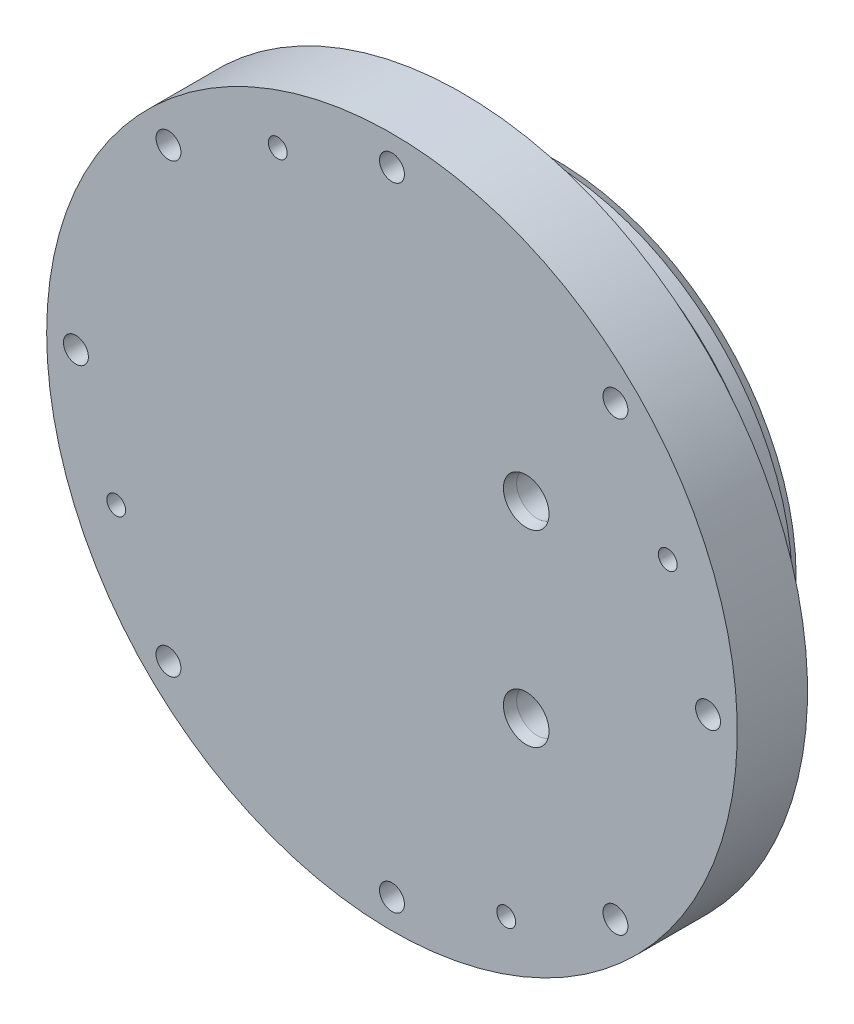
ISO-10303-21;
HEADER;
FILE_DESCRIPTION(('STEP AP214'),'2;1');
FILE_NAME('part.step','',(''),(''),'','','');
FILE_SCHEMA(('AUTOMOTIVE_DESIGN { 1 0 10303 214 1 1 1 1 }'));
ENDSEC;
DATA;
#1=APPLICATION_CONTEXT('core data for automotive mechanical design processes');
#2=APPLICATION_PROTOCOL_DEFINITION('international standard','automotive_design',2000,#1);
#3=PRODUCT_CONTEXT('',#1,'mechanical');
#4=PRODUCT('Part','Part','',(#3));
#5=PRODUCT_RELATED_PRODUCT_CATEGORY('part','',(#4));
#6=PRODUCT_DEFINITION_FORMATION('','',#4);
#7=PRODUCT_DEFINITION_CONTEXT('part definition',#1,'design');
#8=PRODUCT_DEFINITION('design','',#6,#7);
#9=PRODUCT_DEFINITION_SHAPE('','',#8);
#10=(LENGTH_UNIT() NAMED_UNIT(*) SI_UNIT(.MILLI.,.METRE.));
#11=(NAMED_UNIT(*) PLANE_ANGLE_UNIT() SI_UNIT($,.RADIAN.));
#12=(NAMED_UNIT(*) SI_UNIT($,.STERADIAN.) SOLID_ANGLE_UNIT());
#13=UNCERTAINTY_MEASURE_WITH_UNIT(LENGTH_MEASURE(1.E-05),#10,'distance_accuracy_value','');
#14=(GEOMETRIC_REPRESENTATION_CONTEXT(3) GLOBAL_UNCERTAINTY_ASSIGNED_CONTEXT((#13)) GLOBAL_UNIT_ASSIGNED_CONTEXT((#10,
#11,#12)) REPRESENTATION_CONTEXT('',''));
#15=CARTESIAN_POINT('',(0.,0.,0.));
#16=DIRECTION('',(0.,0.,1.));
#17=DIRECTION('',(1.,0.,0.));
#18=AXIS2_PLACEMENT_3D('',#15,#16,#17);
#19=CARTESIAN_POINT('',(0.,0.,-25.4));
#20=DIRECTION('',(0.,0.,1.));
#21=DIRECTION('',(1.,0.,0.));
#22=AXIS2_PLACEMENT_3D('',#19,#20,#21);
#23=CYLINDRICAL_SURFACE('',#22,66.6369);
#24=CARTESIAN_POINT('',(0.,0.,-10.5204909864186));
#25=DIRECTION('',(0.,0.,-1.));
#26=DIRECTION('',(-1.,0.,0.));
#27=AXIS2_PLACEMENT_3D('',#24,#25,#26);
#28=CIRCLE('',#27,66.6369);
#29=CARTESIAN_POINT('',(-66.6369,0.,-10.5204909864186));
#30=VERTEX_POINT('',#29);
#31=EDGE_CURVE('E262',#30,#30,#28,.T.);
#32=ORIENTED_EDGE('',*,*,#31,.T.);
#33=EDGE_LOOP('',(#32));
#34=FACE_BOUND('',#33,.T.);
#35=CARTESIAN_POINT('',(0.,0.,-14.224));
#36=DIRECTION('',(0.,0.,-1.));
#37=DIRECTION('',(-1.,0.,0.));
#38=AXIS2_PLACEMENT_3D('',#35,#36,#37);
#39=CIRCLE('',#38,66.6369);
#40=CARTESIAN_POINT('',(-66.6369,0.,-14.224));
#41=VERTEX_POINT('',#40);
#42=EDGE_CURVE('E283',#41,#41,#39,.T.);
#43=ORIENTED_EDGE('',*,*,#42,.F.);
#44=EDGE_LOOP('',(#43));
#45=FACE_BOUND('',#44,.T.);
#46=ADVANCED_FACE('F32',(#34,#45),#23,.T.);
#47=CARTESIAN_POINT('',(0.,0.,-14.8275652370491));
#48=DIRECTION('',(0.,0.,-1.));
#49=DIRECTION('',(-1.,0.,0.));
#50=AXIS2_PLACEMENT_3D('',#47,#48,#49);
#51=TOROIDAL_SURFACE('',#50,64.109602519,0.381000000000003);
#52=CARTESIAN_POINT('',(0.,0.,-14.8275652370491));
#53=DIRECTION('',(0.,0.,-1.));
#54=DIRECTION('',(-1.,0.,0.));
#55=AXIS2_PLACEMENT_3D('',#52,#53,#54);
#56=CIRCLE('',#55,63.728602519);
#57=CARTESIAN_POINT('',(-63.728602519,0.,-14.8275652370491));
#58=VERTEX_POINT('',#57);
#59=EDGE_CURVE('E271',#58,#58,#56,.T.);
#60=ORIENTED_EDGE('',*,*,#59,.F.);
#61=EDGE_LOOP('',(#60));
#62=FACE_BOUND('',#61,.T.);
#63=CARTESIAN_POINT('',(0.,0.,-14.4480150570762));
#64=DIRECTION('',(0.,0.,-1.));
#65=DIRECTION('',(-1.,0.,0.));
#66=AXIS2_PLACEMENT_3D('',#63,#64,#65);
#67=CIRCLE('',#66,64.0763961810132);
#68=CARTESIAN_POINT('',(-64.0763961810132,0.,-14.4480150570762));
#69=VERTEX_POINT('',#68);
#70=EDGE_CURVE('E286',#69,#69,#67,.T.);
#71=ORIENTED_EDGE('',*,*,#70,.T.);
#72=EDGE_LOOP('',(#71));
#73=FACE_BOUND('',#72,.T.);
#74=ADVANCED_FACE('F353',(#62,#73),#51,.F.);
#75=CARTESIAN_POINT('',(0.,0.,-14.224));
#76=DIRECTION('',(0.,0.,1.));
#77=DIRECTION('',(1.,0.,0.));
#78=AXIS2_PLACEMENT_3D('',#75,#76,#77);
#79=CONICAL_SURFACE('',#78,66.6369,1.48352986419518);
#80=ORIENTED_EDGE('',*,*,#70,.F.);
#81=EDGE_LOOP('',(#80));
#82=FACE_BOUND('',#81,.T.);
#83=ORIENTED_EDGE('',*,*,#42,.T.);
#84=EDGE_LOOP('',(#83));
#85=FACE_BOUND('',#84,.T.);
#86=ADVANCED_FACE('F361',(#82,#85),#79,.T.);
#87=CARTESIAN_POINT('',(0.,0.,-19.0712949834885));
#88=DIRECTION('',(0.,0.,-1.));
#89=DIRECTION('',(-1.,0.,0.));
#90=AXIS2_PLACEMENT_3D('',#87,#88,#89);
#91=CONICAL_SURFACE('',#90,64.0763961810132,1.48352986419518);
#92=CARTESIAN_POINT('',(0.,0.,-19.2953100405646));
#93=DIRECTION('',(0.,0.,-1.));
#94=DIRECTION('',(-1.,0.,0.));
#95=AXIS2_PLACEMENT_3D('',#92,#93,#94);
#96=CIRCLE('',#95,66.6369);
#97=CARTESIAN_POINT('',(-66.6369,0.,-19.2953100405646));
#98=VERTEX_POINT('',#97);
#99=EDGE_CURVE('E280',#98,#98,#96,.T.);
#100=ORIENTED_EDGE('',*,*,#99,.F.);
#101=EDGE_LOOP('',(#100));
#102=FACE_BOUND('',#101,.T.);
#103=CARTESIAN_POINT('',(0.,0.,-19.0712949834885));
#104=DIRECTION('',(0.,0.,-1.));
#105=DIRECTION('',(-1.,0.,0.));
#106=AXIS2_PLACEMENT_3D('',#103,#104,#105);
#107=CIRCLE('',#106,64.0763961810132);
#108=CARTESIAN_POINT('',(-64.0763961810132,0.,-19.0712949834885));
#109=VERTEX_POINT('',#108);
#110=EDGE_CURVE('E277',#109,#109,#107,.T.);
#111=ORIENTED_EDGE('',*,*,#110,.T.);
#112=EDGE_LOOP('',(#111));
#113=FACE_BOUND('',#112,.T.);
#114=ADVANCED_FACE('F415',(#102,#113),#91,.T.);
#115=CARTESIAN_POINT('',(0.,0.,-18.6917448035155));
#116=DIRECTION('',(0.,0.,-1.));
#117=DIRECTION('',(-1.,0.,0.));
#118=AXIS2_PLACEMENT_3D('',#115,#116,#117);
#119=TOROIDAL_SURFACE('',#118,64.109602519,0.381000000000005);
#120=ORIENTED_EDGE('',*,*,#110,.F.);
#121=EDGE_LOOP('',(#120));
#122=FACE_BOUND('',#121,.T.);
#123=CARTESIAN_POINT('',(0.,0.,-18.6917448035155));
#124=DIRECTION('',(0.,0.,-1.));
#125=DIRECTION('',(-1.,0.,0.));
#126=AXIS2_PLACEMENT_3D('',#123,#124,#125);
#127=CIRCLE('',#126,63.728602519);
#128=CARTESIAN_POINT('',(-63.728602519,0.,-18.6917448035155));
#129=VERTEX_POINT('',#128);
#130=EDGE_CURVE('E274',#129,#129,#127,.T.);
#131=ORIENTED_EDGE('',*,*,#130,.T.);
#132=EDGE_LOOP('',(#131));
#133=FACE_BOUND('',#132,.T.);
#134=ADVANCED_FACE('F411',(#122,#133),#119,.F.);
#135=CARTESIAN_POINT('',(0.,0.,24.6));
#136=DIRECTION('',(0.,0.,-1.));
#137=DIRECTION('',(-1.,0.,0.));
#138=AXIS2_PLACEMENT_3D('',#135,#136,#137);
#139=CYLINDRICAL_SURFACE('',#138,63.728602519);
#140=ORIENTED_EDGE('',*,*,#130,.F.);
#141=EDGE_LOOP('',(#140));
#142=FACE_BOUND('',#141,.T.);
#143=ORIENTED_EDGE('',*,*,#59,.T.);
#144=EDGE_LOOP('',(#143));
#145=FACE_BOUND('',#144,.T.);
#146=ADVANCED_FACE('F407',(#142,#145),#139,.T.);
#147=CARTESIAN_POINT('',(0.,0.,-25.4));
#148=DIRECTION('',(0.,0.,-1.));
#149=DIRECTION('',(-1.,0.,0.));
#150=AXIS2_PLACEMENT_3D('',#147,#148,#149);
#151=PLANE('',#150);
#152=CARTESIAN_POINT('',(-31.75,-25.4,-25.4));
#153=DIRECTION('',(0.,0.,-1.));
#154=DIRECTION('',(-1.,0.,0.));
#155=AXIS2_PLACEMENT_3D('',#152,#153,#154);
#156=CIRCLE('',#155,1.7526);
#157=CARTESIAN_POINT('',(-33.5026,-25.4,-25.4));
#158=VERTEX_POINT('',#157);
#159=EDGE_CURVE('E76',#158,#158,#156,.T.);
#160=ORIENTED_EDGE('',*,*,#159,.F.);
#161=EDGE_LOOP('',(#160));
#162=FACE_BOUND('',#161,.T.);
#163=CARTESIAN_POINT('',(-31.75,0.,-25.4));
#164=DIRECTION('',(0.,0.,-1.));
#165=DIRECTION('',(-1.,0.,0.));
#166=AXIS2_PLACEMENT_3D('',#163,#164,#165);
#167=CIRCLE('',#166,1.7526);
#168=CARTESIAN_POINT('',(-33.5026,0.,-25.4));
#169=VERTEX_POINT('',#168);
#170=EDGE_CURVE('E88',#169,#169,#167,.T.);
#171=ORIENTED_EDGE('',*,*,#170,.F.);
#172=EDGE_LOOP('',(#171));
#173=FACE_BOUND('',#172,.T.);
#174=CARTESIAN_POINT('',(-31.75,25.4,-25.4));
#175=DIRECTION('',(0.,0.,-1.));
#176=DIRECTION('',(-1.,0.,0.));
#177=AXIS2_PLACEMENT_3D('',#174,#175,#176);
#178=CIRCLE('',#177,1.7526);
#179=CARTESIAN_POINT('',(-33.5026,25.4,-25.4));
#180=VERTEX_POINT('',#179);
#181=EDGE_CURVE('E100',#180,#180,#178,.T.);
#182=ORIENTED_EDGE('',*,*,#181,.F.);
#183=EDGE_LOOP('',(#182));
#184=FACE_BOUND('',#183,.T.);
#185=CARTESIAN_POINT('',(-6.35,-25.4,-25.4));
#186=DIRECTION('',(0.,0.,-1.));
#187=DIRECTION('',(-1.,0.,0.));
#188=AXIS2_PLACEMENT_3D('',#185,#186,#187);
#189=CIRCLE('',#188,1.7526);
#190=CARTESIAN_POINT('',(-8.1026,-25.4,-25.4));
#191=VERTEX_POINT('',#190);
#192=EDGE_CURVE('E112',#191,#191,#189,.T.);
#193=ORIENTED_EDGE('',*,*,#192,.F.);
#194=EDGE_LOOP('',(#193));
#195=FACE_BOUND('',#194,.T.);
#196=CARTESIAN_POINT('',(-6.35,0.,-25.4));
#197=DIRECTION('',(0.,0.,-1.));
#198=DIRECTION('',(-1.,0.,0.));
#199=AXIS2_PLACEMENT_3D('',#196,#197,#198);
#200=CIRCLE('',#199,1.7526);
#201=CARTESIAN_POINT('',(-8.1026,0.,-25.4));
#202=VERTEX_POINT('',#201);
#203=EDGE_CURVE('E124',#202,#202,#200,.T.);
#204=ORIENTED_EDGE('',*,*,#203,.F.);
#205=EDGE_LOOP('',(#204));
#206=FACE_BOUND('',#205,.T.);
#207=CARTESIAN_POINT('',(-6.35,25.4,-25.4));
#208=DIRECTION('',(0.,0.,-1.));
#209=DIRECTION('',(-1.,0.,0.));
#210=AXIS2_PLACEMENT_3D('',#207,#208,#209);
#211=CIRCLE('',#210,1.7526);
#212=CARTESIAN_POINT('',(-8.1026,25.4,-25.4));
#213=VERTEX_POINT('',#212);
#214=EDGE_CURVE('E136',#213,#213,#211,.T.);
#215=ORIENTED_EDGE('',*,*,#214,.F.);
#216=EDGE_LOOP('',(#215));
#217=FACE_BOUND('',#216,.T.);
#218=CARTESIAN_POINT('',(36.4113083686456,-25.495472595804,-25.3999999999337));
#219=DIRECTION('',(0.,0.,-1.));
#220=DIRECTION('',(-1.,0.,0.));
#221=AXIS2_PLACEMENT_3D('',#218,#219,#220);
#222=CIRCLE('',#221,6.1849);
#223=CARTESIAN_POINT('',(30.2264083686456,-25.495472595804,-25.3999999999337));
#224=VERTEX_POINT('',#223);
#225=EDGE_CURVE('E187',#224,#224,#222,.T.);
#226=ORIENTED_EDGE('',*,*,#225,.F.);
#227=EDGE_LOOP('',(#226));
#228=FACE_BOUND('',#227,.T.);
#229=CARTESIAN_POINT('',(36.4113083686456,25.495472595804,-25.4000000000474));
#230=DIRECTION('',(0.,0.,-1.));
#231=DIRECTION('',(-1.,0.,0.));
#232=AXIS2_PLACEMENT_3D('',#229,#230,#231);
#233=CIRCLE('',#232,6.1849);
#234=CARTESIAN_POINT('',(30.2264083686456,25.495472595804,-25.4000000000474));
#235=VERTEX_POINT('',#234);
#236=EDGE_CURVE('E196',#235,#235,#233,.T.);
#237=ORIENTED_EDGE('',*,*,#236,.F.);
#238=EDGE_LOOP('',(#237));
#239=FACE_BOUND('',#238,.T.);
#240=CARTESIAN_POINT('',(0.,0.,-25.4));
#241=DIRECTION('',(0.,0.,-1.));
#242=DIRECTION('',(-1.,0.,0.));
#243=AXIS2_PLACEMENT_3D('',#240,#241,#242);
#244=CIRCLE('',#243,65.1704303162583);
#245=CARTESIAN_POINT('',(-65.1704303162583,0.,-25.4));
#246=VERTEX_POINT('',#245);
#247=EDGE_CURVE('E295',#246,#246,#244,.T.);
#248=ORIENTED_EDGE('',*,*,#247,.T.);
#249=EDGE_LOOP('',(#248));
#250=FACE_BOUND('',#249,.T.);
#251=ADVANCED_FACE('F410',(#162,#173,#184,#195,#206,#217,#228,#239,#250),#151,.T.);
#252=CARTESIAN_POINT('',(0.,0.,-25.4));
#253=DIRECTION('',(0.,0.,1.));
#254=DIRECTION('',(1.,0.,0.));
#255=AXIS2_PLACEMENT_3D('',#252,#253,#254);
#256=CONICAL_SURFACE('',#255,65.1704303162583,0.523598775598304);
#257=CARTESIAN_POINT('',(0.,0.,-22.86));
#258=DIRECTION('',(0.,0.,-1.));
#259=DIRECTION('',(-1.,0.,0.));
#260=AXIS2_PLACEMENT_3D('',#257,#258,#259);
#261=CIRCLE('',#260,66.6369);
#262=CARTESIAN_POINT('',(-66.6369,0.,-22.86));
#263=VERTEX_POINT('',#262);
#264=EDGE_CURVE('E298',#263,#263,#261,.F.);
#265=ORIENTED_EDGE('',*,*,#264,.F.);
#266=EDGE_LOOP('',(#265));
#267=FACE_BOUND('',#266,.T.);
#268=ORIENTED_EDGE('',*,*,#247,.F.);
#269=EDGE_LOOP('',(#268));
#270=FACE_BOUND('',#269,.T.);
#271=ADVANCED_FACE('F369',(#267,#270),#256,.T.);
#272=ORIENTED_EDGE('',*,*,#99,.T.);
#273=EDGE_LOOP('',(#272));
#274=FACE_BOUND('',#273,.T.);
#275=ORIENTED_EDGE('',*,*,#264,.T.);
#276=EDGE_LOOP('',(#275));
#277=FACE_BOUND('',#276,.T.);
#278=ADVANCED_FACE('F356',(#274,#277),#23,.T.);
#279=CARTESIAN_POINT('',(0.,0.,-5.9934481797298));
#280=DIRECTION('',(0.,0.,-1.));
#281=DIRECTION('',(-1.,0.,0.));
#282=AXIS2_PLACEMENT_3D('',#279,#280,#281);
#283=TOROIDAL_SURFACE('',#282,64.160399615,0.44449961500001);
#284=CARTESIAN_POINT('',(0.,0.,-5.9934481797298));
#285=DIRECTION('',(0.,0.,-1.));
#286=DIRECTION('',(-1.,0.,0.));
#287=AXIS2_PLACEMENT_3D('',#284,#285,#286);
#288=CIRCLE('',#287,63.7159);
#289=CARTESIAN_POINT('',(-63.7159,0.,-5.9934481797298));
#290=VERTEX_POINT('',#289);
#291=EDGE_CURVE('E253',#290,#290,#288,.T.);
#292=ORIENTED_EDGE('',*,*,#291,.F.);
#293=EDGE_LOOP('',(#292));
#294=FACE_BOUND('',#293,.T.);
#295=CARTESIAN_POINT('',(0.,0.,-5.55064001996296));
#296=DIRECTION('',(0.,0.,-1.));
#297=DIRECTION('',(-1.,0.,0.));
#298=AXIS2_PLACEMENT_3D('',#295,#296,#297);
#299=CIRCLE('',#298,64.1216589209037);
#300=CARTESIAN_POINT('',(-64.1216589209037,0.,-5.55064001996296));
#301=VERTEX_POINT('',#300);
#302=EDGE_CURVE('E268',#301,#301,#299,.T.);
#303=ORIENTED_EDGE('',*,*,#302,.T.);
#304=EDGE_LOOP('',(#303));
#305=FACE_BOUND('',#304,.T.);
#306=ADVANCED_FACE('F368',(#294,#305),#283,.F.);
#307=CARTESIAN_POINT('',(0.,0.,-5.33058493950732));
#308=DIRECTION('',(0.,0.,1.));
#309=DIRECTION('',(1.,0.,0.));
#310=AXIS2_PLACEMENT_3D('',#307,#308,#309);
#311=CONICAL_SURFACE('',#310,66.6369,1.48352986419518);
#312=ORIENTED_EDGE('',*,*,#302,.F.);
#313=EDGE_LOOP('',(#312));
#314=FACE_BOUND('',#313,.T.);
#315=CARTESIAN_POINT('',(0.,0.,-5.33058493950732));
#316=DIRECTION('',(0.,0.,-1.));
#317=DIRECTION('',(-1.,0.,0.));
#318=AXIS2_PLACEMENT_3D('',#315,#316,#317);
#319=CIRCLE('',#318,66.6369);
#320=CARTESIAN_POINT('',(-66.6369,0.,-5.33058493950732));
#321=VERTEX_POINT('',#320);
#322=EDGE_CURVE('E265',#321,#321,#319,.T.);
#323=ORIENTED_EDGE('',*,*,#322,.T.);
#324=EDGE_LOOP('',(#323));
#325=FACE_BOUND('',#324,.T.);
#326=ADVANCED_FACE('F390',(#314,#325),#311,.T.);
#327=CARTESIAN_POINT('',(0.,0.,-10.300435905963));
#328=DIRECTION('',(0.,0.,-1.));
#329=DIRECTION('',(-1.,0.,0.));
#330=AXIS2_PLACEMENT_3D('',#327,#328,#329);
#331=CONICAL_SURFACE('',#330,64.1216589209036,1.48352986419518);
#332=ORIENTED_EDGE('',*,*,#31,.F.);
#333=EDGE_LOOP('',(#332));
#334=FACE_BOUND('',#333,.T.);
#335=CARTESIAN_POINT('',(0.,0.,-10.300435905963));
#336=DIRECTION('',(0.,0.,-1.));
#337=DIRECTION('',(-1.,0.,0.));
#338=AXIS2_PLACEMENT_3D('',#335,#336,#337);
#339=CIRCLE('',#338,64.1216589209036);
#340=CARTESIAN_POINT('',(-64.1216589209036,0.,-10.300435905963));
#341=VERTEX_POINT('',#340);
#342=EDGE_CURVE('E259',#341,#341,#339,.T.);
#343=ORIENTED_EDGE('',*,*,#342,.T.);
#344=EDGE_LOOP('',(#343));
#345=FACE_BOUND('',#344,.T.);
#346=ADVANCED_FACE('F392',(#334,#345),#331,.T.);
#347=CARTESIAN_POINT('',(0.,0.,-9.85762774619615));
#348=DIRECTION('',(0.,0.,-1.));
#349=DIRECTION('',(-1.,0.,0.));
#350=AXIS2_PLACEMENT_3D('',#347,#348,#349);
#351=TOROIDAL_SURFACE('',#350,64.160399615,0.444499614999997);
#352=ORIENTED_EDGE('',*,*,#342,.F.);
#353=EDGE_LOOP('',(#352));
#354=FACE_BOUND('',#353,.T.);
#355=CARTESIAN_POINT('',(0.,0.,-9.85762774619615));
#356=DIRECTION('',(0.,0.,-1.));
#357=DIRECTION('',(-1.,0.,0.));
#358=AXIS2_PLACEMENT_3D('',#355,#356,#357);
#359=CIRCLE('',#358,63.7159);
#360=CARTESIAN_POINT('',(-63.7159,0.,-9.85762774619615));
#361=VERTEX_POINT('',#360);
#362=EDGE_CURVE('E256',#361,#361,#359,.T.);
#363=ORIENTED_EDGE('',*,*,#362,.T.);
#364=EDGE_LOOP('',(#363));
#365=FACE_BOUND('',#364,.T.);
#366=ADVANCED_FACE('F399',(#354,#365),#351,.F.);
#367=CARTESIAN_POINT('',(0.,0.,24.6));
#368=DIRECTION('',(0.,0.,-1.));
#369=DIRECTION('',(-1.,0.,0.));
#370=AXIS2_PLACEMENT_3D('',#367,#368,#369);
#371=CYLINDRICAL_SURFACE('',#370,63.7159);
#372=ORIENTED_EDGE('',*,*,#362,.F.);
#373=EDGE_LOOP('',(#372));
#374=FACE_BOUND('',#373,.T.);
#375=ORIENTED_EDGE('',*,*,#291,.T.);
#376=EDGE_LOOP('',(#375));
#377=FACE_BOUND('',#376,.T.);
#378=ADVANCED_FACE('F830',(#374,#377),#371,.T.);
#379=CARTESIAN_POINT('',(0.,0.,19.05));
#380=DIRECTION('',(0.,0.,1.));
#381=DIRECTION('',(1.,0.,0.));
#382=AXIS2_PLACEMENT_3D('',#379,#380,#381);
#383=PLANE('',#382);
#384=CARTESIAN_POINT('',(-74.7995966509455,-30.9830073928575,19.0500000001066));
#385=DIRECTION('',(0.,0.,-1.));
#386=DIRECTION('',(-1.,0.,0.));
#387=AXIS2_PLACEMENT_3D('',#384,#385,#386);
#388=CIRCLE('',#387,2.55269999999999);
#389=CARTESIAN_POINT('',(-77.3522966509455,-30.9830073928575,19.0500000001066));
#390=VERTEX_POINT('',#389);
#391=EDGE_CURVE('E148',#390,#390,#388,.T.);
#392=ORIENTED_EDGE('',*,*,#391,.T.);
#393=EDGE_LOOP('',(#392));
#394=FACE_BOUND('',#393,.T.);
#395=CARTESIAN_POINT('',(30.9830073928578,-74.7995966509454,19.0500000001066));
#396=DIRECTION('',(0.,0.,-1.));
#397=DIRECTION('',(-1.,0.,0.));
#398=AXIS2_PLACEMENT_3D('',#395,#396,#397);
#399=CIRCLE('',#398,2.5527);
#400=CARTESIAN_POINT('',(28.4303073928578,-74.7995966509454,19.0500000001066));
#401=VERTEX_POINT('',#400);
#402=EDGE_CURVE('E160',#401,#401,#399,.T.);
#403=ORIENTED_EDGE('',*,*,#402,.T.);
#404=EDGE_LOOP('',(#403));
#405=FACE_BOUND('',#404,.T.);
#406=CARTESIAN_POINT('',(74.7995966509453,30.9830073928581,19.0500000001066));
#407=DIRECTION('',(0.,0.,-1.));
#408=DIRECTION('',(-1.,0.,0.));
#409=AXIS2_PLACEMENT_3D('',#406,#407,#408);
#410=CIRCLE('',#409,2.55269999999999);
#411=CARTESIAN_POINT('',(72.2468966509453,30.9830073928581,19.0500000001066));
#412=VERTEX_POINT('',#411);
#413=EDGE_CURVE('E172',#412,#412,#410,.T.);
#414=ORIENTED_EDGE('',*,*,#413,.T.);
#415=EDGE_LOOP('',(#414));
#416=FACE_BOUND('',#415,.T.);
#417=CARTESIAN_POINT('',(-30.9830073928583,74.7995966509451,19.0500000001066));
#418=DIRECTION('',(0.,0.,-1.));
#419=DIRECTION('',(-1.,0.,0.));
#420=AXIS2_PLACEMENT_3D('',#417,#418,#419);
#421=CIRCLE('',#420,2.55269999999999);
#422=CARTESIAN_POINT('',(-33.5357073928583,74.7995966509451,19.0500000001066));
#423=VERTEX_POINT('',#422);
#424=EDGE_CURVE('E184',#423,#423,#421,.T.);
#425=ORIENTED_EDGE('',*,*,#424,.T.);
#426=EDGE_LOOP('',(#425));
#427=FACE_BOUND('',#426,.T.);
#428=CARTESIAN_POINT('',(36.4113083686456,-25.495472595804,19.0500000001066));
#429=DIRECTION('',(0.,0.,1.));
#430=DIRECTION('',(1.,0.,0.));
#431=AXIS2_PLACEMENT_3D('',#428,#429,#430);
#432=CIRCLE('',#431,6.1849);
#433=CARTESIAN_POINT('',(42.5962083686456,-25.495472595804,19.0500000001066));
#434=VERTEX_POINT('',#433);
#435=EDGE_CURVE('E208',#434,#434,#432,.T.);
#436=ORIENTED_EDGE('',*,*,#435,.F.);
#437=EDGE_LOOP('',(#436));
#438=FACE_BOUND('',#437,.T.);
#439=CARTESIAN_POINT('',(36.4113083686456,25.4954725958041,19.0500000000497));
#440=DIRECTION('',(0.,0.,1.));
#441=DIRECTION('',(1.,0.,0.));
#442=AXIS2_PLACEMENT_3D('',#439,#440,#441);
#443=CIRCLE('',#442,6.1849);
#444=CARTESIAN_POINT('',(42.5962083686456,25.4954725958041,19.0500000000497));
#445=VERTEX_POINT('',#444);
#446=EDGE_CURVE('E220',#445,#445,#443,.T.);
#447=ORIENTED_EDGE('',*,*,#446,.F.);
#448=EDGE_LOOP('',(#447));
#449=FACE_BOUND('',#448,.T.);
#450=CARTESIAN_POINT('',(60.616728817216,60.6167288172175,19.05));
#451=DIRECTION('',(0.,0.,1.));
#452=DIRECTION('',(1.,0.,0.));
#453=AXIS2_PLACEMENT_3D('',#450,#451,#452);
#454=CIRCLE('',#453,3.37819999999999);
#455=CARTESIAN_POINT('',(63.994928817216,60.6167288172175,19.05));
#456=VERTEX_POINT('',#455);
#457=EDGE_CURVE('E229',#456,#456,#454,.T.);
#458=ORIENTED_EDGE('',*,*,#457,.F.);
#459=EDGE_LOOP('',(#458));
#460=FACE_BOUND('',#459,.T.);
#461=CARTESIAN_POINT('',(85.725,8.97922233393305E-13,19.05));
#462=DIRECTION('',(0.,0.,1.));
#463=DIRECTION('',(1.,0.,0.));
#464=AXIS2_PLACEMENT_3D('',#461,#462,#463);
#465=CIRCLE('',#464,3.37819999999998);
#466=CARTESIAN_POINT('',(89.1032,8.97922233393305E-13,19.05));
#467=VERTEX_POINT('',#466);
#468=EDGE_CURVE('E232',#467,#467,#465,.T.);
#469=ORIENTED_EDGE('',*,*,#468,.F.);
#470=EDGE_LOOP('',(#469));
#471=FACE_BOUND('',#470,.T.);
#472=CARTESIAN_POINT('',(60.6167288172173,-60.6167288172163,19.05));
#473=DIRECTION('',(0.,0.,1.));
#474=DIRECTION('',(1.,0.,0.));
#475=AXIS2_PLACEMENT_3D('',#472,#473,#474);
#476=CIRCLE('',#475,3.37819999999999);
#477=CARTESIAN_POINT('',(63.9949288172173,-60.6167288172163,19.05));
#478=VERTEX_POINT('',#477);
#479=EDGE_CURVE('E235',#478,#478,#476,.T.);
#480=ORIENTED_EDGE('',*,*,#479,.F.);
#481=EDGE_LOOP('',(#480));
#482=FACE_BOUND('',#481,.T.);
#483=CARTESIAN_POINT('',(5.98614822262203E-13,-85.725,19.05));
#484=DIRECTION('',(0.,0.,1.));
#485=DIRECTION('',(1.,0.,0.));
#486=AXIS2_PLACEMENT_3D('',#483,#484,#485);
#487=CIRCLE('',#486,3.37819999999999);
#488=CARTESIAN_POINT('',(3.37820000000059,-85.725,19.05));
#489=VERTEX_POINT('',#488);
#490=EDGE_CURVE('E238',#489,#489,#487,.T.);
#491=ORIENTED_EDGE('',*,*,#490,.F.);
#492=EDGE_LOOP('',(#491));
#493=FACE_BOUND('',#492,.T.);
#494=CARTESIAN_POINT('',(-60.6167288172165,-60.6167288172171,19.05));
#495=DIRECTION('',(0.,0.,1.));
#496=DIRECTION('',(1.,0.,0.));
#497=AXIS2_PLACEMENT_3D('',#494,#495,#496);
#498=CIRCLE('',#497,3.37819999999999);
#499=CARTESIAN_POINT('',(-57.2385288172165,-60.6167288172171,19.05));
#500=VERTEX_POINT('',#499);
#501=EDGE_CURVE('E241',#500,#500,#498,.T.);
#502=ORIENTED_EDGE('',*,*,#501,.F.);
#503=EDGE_LOOP('',(#502));
#504=FACE_BOUND('',#503,.T.);
#505=CARTESIAN_POINT('',(-85.725,-2.99307411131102E-13,19.05));
#506=DIRECTION('',(0.,0.,1.));
#507=DIRECTION('',(1.,0.,0.));
#508=AXIS2_PLACEMENT_3D('',#505,#506,#507);
#509=CIRCLE('',#508,3.37819999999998);
#510=CARTESIAN_POINT('',(-82.3468,-2.99307411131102E-13,19.05));
#511=VERTEX_POINT('',#510);
#512=EDGE_CURVE('E244',#511,#511,#509,.T.);
#513=ORIENTED_EDGE('',*,*,#512,.F.);
#514=EDGE_LOOP('',(#513));
#515=FACE_BOUND('',#514,.T.);
#516=CARTESIAN_POINT('',(-60.6167288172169,60.6167288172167,19.05));
#517=DIRECTION('',(0.,0.,1.));
#518=DIRECTION('',(1.,0.,0.));
#519=AXIS2_PLACEMENT_3D('',#516,#517,#518);
#520=CIRCLE('',#519,3.37819999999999);
#521=CARTESIAN_POINT('',(-57.2385288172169,60.6167288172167,19.05));
#522=VERTEX_POINT('',#521);
#523=EDGE_CURVE('E247',#522,#522,#520,.T.);
#524=ORIENTED_EDGE('',*,*,#523,.F.);
#525=EDGE_LOOP('',(#524));
#526=FACE_BOUND('',#525,.T.);
#527=CARTESIAN_POINT('',(0.,85.725,19.05));
#528=DIRECTION('',(0.,0.,1.));
#529=DIRECTION('',(1.,0.,0.));
#530=AXIS2_PLACEMENT_3D('',#527,#528,#529);
#531=CIRCLE('',#530,3.37819999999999);
#532=CARTESIAN_POINT('',(3.37819999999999,85.725,19.05));
#533=VERTEX_POINT('',#532);
#534=EDGE_CURVE('E250',#533,#533,#531,.T.);
#535=ORIENTED_EDGE('',*,*,#534,.F.);
#536=EDGE_LOOP('',(#535));
#537=FACE_BOUND('',#536,.T.);
#538=CARTESIAN_POINT('',(0.,0.,19.05));
#539=DIRECTION('',(0.,0.,1.));
#540=DIRECTION('',(1.,0.,0.));
#541=AXIS2_PLACEMENT_3D('',#538,#539,#540);
#542=CIRCLE('',#541,93.6625);
#543=CARTESIAN_POINT('',(-93.6625,0.,19.05));
#544=VERTEX_POINT('',#543);
#545=EDGE_CURVE('E292',#544,#544,#542,.T.);
#546=ORIENTED_EDGE('',*,*,#545,.T.);
#547=EDGE_LOOP('',(#546));
#548=FACE_BOUND('',#547,.T.);
#549=ADVANCED_FACE('F839',(#394,#405,#416,#427,#438,#449,#460,#471,#482,#493,#504,#515,#526,
#537,#548),#383,.T.);
#550=CARTESIAN_POINT('',(0.,0.,19.05));
#551=DIRECTION('',(0.,0.,-1.));
#552=DIRECTION('',(-1.,0.,0.));
#553=AXIS2_PLACEMENT_3D('',#550,#551,#552);
#554=CYLINDRICAL_SURFACE('',#553,93.6625);
#555=CARTESIAN_POINT('',(0.,0.,0.));
#556=DIRECTION('',(0.,0.,1.));
#557=DIRECTION('',(1.,0.,0.));
#558=AXIS2_PLACEMENT_3D('',#555,#556,#557);
#559=CIRCLE('',#558,93.6625);
#560=CARTESIAN_POINT('',(-93.6625,0.,0.));
#561=VERTEX_POINT('',#560);
#562=EDGE_CURVE('E289',#561,#561,#559,.T.);
#563=CARTESIAN_POINT('',(-93.6625,0.,19.05));
#564=CARTESIAN_POINT('',(-93.6625,0.,18.8515625));
#565=CARTESIAN_POINT('',(-93.6625,0.,18.653125));
#566=CARTESIAN_POINT('',(-93.6625,0.,18.25625));
#567=CARTESIAN_POINT('',(-93.6625,0.,18.0578125));
#568=CARTESIAN_POINT('',(-93.6625,0.,17.6609375));
#569=CARTESIAN_POINT('',(-93.6625,0.,17.4625));
#570=CARTESIAN_POINT('',(-93.6625,0.,17.065625));
#571=CARTESIAN_POINT('',(-93.6625,0.,16.8671875));
#572=CARTESIAN_POINT('',(-93.6625,0.,16.4703125));
#573=CARTESIAN_POINT('',(-93.6625,0.,16.271875));
#574=CARTESIAN_POINT('',(-93.6625,0.,15.875));
#575=CARTESIAN_POINT('',(-93.6625,0.,15.6765625));
#576=CARTESIAN_POINT('',(-93.6625,0.,15.2796875));
#577=CARTESIAN_POINT('',(-93.6625,0.,15.08125));
#578=CARTESIAN_POINT('',(-93.6625,0.,14.684375));
#579=CARTESIAN_POINT('',(-93.6625,0.,14.4859375));
#580=CARTESIAN_POINT('',(-93.6625,0.,14.0890625));
#581=CARTESIAN_POINT('',(-93.6625,0.,13.890625));
#582=CARTESIAN_POINT('',(-93.6625,0.,13.49375));
#583=CARTESIAN_POINT('',(-93.6625,0.,13.2953125));
#584=CARTESIAN_POINT('',(-93.6625,0.,12.8984375));
#585=CARTESIAN_POINT('',(-93.6625,0.,12.7));
#586=CARTESIAN_POINT('',(-93.6625,0.,12.303125));
#587=CARTESIAN_POINT('',(-93.6625,0.,12.1046875));
#588=CARTESIAN_POINT('',(-93.6625,0.,11.7078125));
#589=CARTESIAN_POINT('',(-93.6625,0.,11.509375));
#590=CARTESIAN_POINT('',(-93.6625,0.,11.1125));
#591=CARTESIAN_POINT('',(-93.6625,0.,10.9140625));
#592=CARTESIAN_POINT('',(-93.6625,0.,10.5171875));
#593=CARTESIAN_POINT('',(-93.6625,0.,10.31875));
#594=CARTESIAN_POINT('',(-93.6625,0.,9.921875));
#595=CARTESIAN_POINT('',(-93.6625,0.,9.7234375));
#596=CARTESIAN_POINT('',(-93.6625,0.,9.3265625));
#597=CARTESIAN_POINT('',(-93.6625,0.,9.128125));
#598=CARTESIAN_POINT('',(-93.6625,0.,8.73125));
#599=CARTESIAN_POINT('',(-93.6625,0.,8.5328125));
#600=CARTESIAN_POINT('',(-93.6625,0.,8.1359375));
#601=CARTESIAN_POINT('',(-93.6625,0.,7.9375));
#602=CARTESIAN_POINT('',(-93.6625,0.,7.540625));
#603=CARTESIAN_POINT('',(-93.6625,0.,7.3421875));
#604=CARTESIAN_POINT('',(-93.6625,0.,6.9453125));
#605=CARTESIAN_POINT('',(-93.6625,0.,6.746875));
#606=CARTESIAN_POINT('',(-93.6625,0.,6.35));
#607=CARTESIAN_POINT('',(-93.6625,0.,6.1515625));
#608=CARTESIAN_POINT('',(-93.6625,0.,5.7546875));
#609=CARTESIAN_POINT('',(-93.6625,0.,5.55625));
#610=CARTESIAN_POINT('',(-93.6625,0.,5.159375));
#611=CARTESIAN_POINT('',(-93.6625,0.,4.9609375));
#612=CARTESIAN_POINT('',(-93.6625,0.,4.5640625));
#613=CARTESIAN_POINT('',(-93.6625,0.,4.365625));
#614=CARTESIAN_POINT('',(-93.6625,0.,3.96875));
#615=CARTESIAN_POINT('',(-93.6625,0.,3.7703125));
#616=CARTESIAN_POINT('',(-93.6625,0.,3.3734375));
#617=CARTESIAN_POINT('',(-93.6625,0.,3.175));
#618=CARTESIAN_POINT('',(-93.6625,0.,2.778125));
#619=CARTESIAN_POINT('',(-93.6625,0.,2.5796875));
#620=CARTESIAN_POINT('',(-93.6625,0.,2.1828125));
#621=CARTESIAN_POINT('',(-93.6625,0.,1.984375));
#622=CARTESIAN_POINT('',(-93.6625,0.,1.5875));
#623=CARTESIAN_POINT('',(-93.6625,0.,1.3890625));
#624=CARTESIAN_POINT('',(-93.6625,0.,0.992187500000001));
#625=CARTESIAN_POINT('',(-93.6625,0.,0.793750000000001));
#626=CARTESIAN_POINT('',(-93.6625,0.,0.396875));
#627=CARTESIAN_POINT('',(-93.6625,0.,0.1984375));
#628=CARTESIAN_POINT('',(-93.6625,0.,0.));
#629=B_SPLINE_CURVE_WITH_KNOTS('',3,(#563,#564,#565,#566,#567,#568,#569,#570,#571,#572,#573,
#574,#575,#576,#577,#578,#579,#580,#581,#582,#583,#584,#585,#586,#587,#588,#589,#590,#591,#592,
#593,#594,#595,#596,#597,#598,#599,#600,#601,#602,#603,#604,#605,#606,#607,#608,#609,#610,#611,
#612,#613,#614,#615,#616,#617,#618,#619,#620,#621,#622,#623,#624,#625,#626,#627,#628),
.UNSPECIFIED.,.F.,.F.,(4,2,2,2,2,2,2,2,2,2,2,2,2,2,2,2,2,2,2,2,2,2,2,2,2,2,2,2,2,2,2,2,4),(0.,
0.595312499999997,1.190625,1.7859375,2.38125,2.9765625,3.571875,4.1671875,4.7625,5.3578125,
5.953125,6.5484375,7.14375,7.7390625,8.334375,8.9296875,9.525,10.1203125,10.715625,11.3109375,
11.90625,12.5015625,13.096875,13.6921875,14.2875,14.8828125,15.478125,16.0734375,16.66875,
17.2640625,17.859375,18.4546875,19.05),.UNSPECIFIED.);
#630=EDGE_CURVE('BSEAM34',#544,#561,#629,.T.);
#631=ORIENTED_EDGE('',*,*,#545,.F.);
#632=ORIENTED_EDGE('',*,*,#562,.T.);
#633=ORIENTED_EDGE('',*,*,#630,.T.);
#634=ORIENTED_EDGE('',*,*,#630,.F.);
#635=EDGE_LOOP('',(#631,#633,#632,#634));
#636=FACE_BOUND('',#635,.T.);
#637=ADVANCED_FACE('F34',(#636),#554,.T.);
#638=CARTESIAN_POINT('',(0.,0.,0.));
#639=DIRECTION('',(0.,0.,1.));
#640=DIRECTION('',(1.,0.,0.));
#641=AXIS2_PLACEMENT_3D('',#638,#639,#640);
#642=PLANE('',#641);
#643=CARTESIAN_POINT('',(-74.7995966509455,-30.9830073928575,0.));
#644=DIRECTION('',(0.,0.,-1.));
#645=DIRECTION('',(-1.,0.,0.));
#646=AXIS2_PLACEMENT_3D('',#643,#644,#645);
#647=CIRCLE('',#646,4.7625);
#648=CARTESIAN_POINT('',(-79.5620966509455,-30.9830073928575,0.));
#649=VERTEX_POINT('',#648);
#650=EDGE_CURVE('E139',#649,#649,#647,.T.);
#651=ORIENTED_EDGE('',*,*,#650,.F.);
#652=EDGE_LOOP('',(#651));
#653=FACE_BOUND('',#652,.T.);
#654=CARTESIAN_POINT('',(30.9830073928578,-74.7995966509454,0.));
#655=DIRECTION('',(0.,0.,-1.));
#656=DIRECTION('',(-1.,0.,0.));
#657=AXIS2_PLACEMENT_3D('',#654,#655,#656);
#658=CIRCLE('',#657,4.7625);
#659=CARTESIAN_POINT('',(26.2205073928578,-74.7995966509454,0.));
#660=VERTEX_POINT('',#659);
#661=EDGE_CURVE('E151',#660,#660,#658,.T.);
#662=ORIENTED_EDGE('',*,*,#661,.F.);
#663=EDGE_LOOP('',(#662));
#664=FACE_BOUND('',#663,.T.);
#665=CARTESIAN_POINT('',(74.7995966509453,30.9830073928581,0.));
#666=DIRECTION('',(0.,0.,-1.));
#667=DIRECTION('',(-1.,0.,0.));
#668=AXIS2_PLACEMENT_3D('',#665,#666,#667);
#669=CIRCLE('',#668,4.7625);
#670=CARTESIAN_POINT('',(70.0370966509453,30.9830073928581,0.));
#671=VERTEX_POINT('',#670);
#672=EDGE_CURVE('E163',#671,#671,#669,.T.);
#673=ORIENTED_EDGE('',*,*,#672,.F.);
#674=EDGE_LOOP('',(#673));
#675=FACE_BOUND('',#674,.T.);
#676=CARTESIAN_POINT('',(-30.9830073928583,74.7995966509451,0.));
#677=DIRECTION('',(0.,0.,-1.));
#678=DIRECTION('',(-1.,0.,0.));
#679=AXIS2_PLACEMENT_3D('',#676,#677,#678);
#680=CIRCLE('',#679,4.7625);
#681=CARTESIAN_POINT('',(-35.7455073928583,74.7995966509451,0.));
#682=VERTEX_POINT('',#681);
#683=EDGE_CURVE('E175',#682,#682,#680,.T.);
#684=ORIENTED_EDGE('',*,*,#683,.F.);
#685=EDGE_LOOP('',(#684));
#686=FACE_BOUND('',#685,.T.);
#687=CARTESIAN_POINT('',(60.616728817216,60.6167288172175,0.));
#688=DIRECTION('',(0.,0.,1.));
#689=DIRECTION('',(1.,0.,0.));
#690=AXIS2_PLACEMENT_3D('',#687,#688,#689);
#691=CIRCLE('',#690,3.37819999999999);
#692=CARTESIAN_POINT('',(63.994928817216,60.6167288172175,0.));
#693=VERTEX_POINT('',#692);
#694=EDGE_CURVE('E328',#693,#693,#691,.T.);
#695=ORIENTED_EDGE('',*,*,#694,.T.);
#696=EDGE_LOOP('',(#695));
#697=FACE_BOUND('',#696,.T.);
#698=CARTESIAN_POINT('',(85.725,8.97922233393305E-13,0.));
#699=DIRECTION('',(0.,0.,1.));
#700=DIRECTION('',(1.,0.,0.));
#701=AXIS2_PLACEMENT_3D('',#698,#699,#700);
#702=CIRCLE('',#701,3.37819999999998);
#703=CARTESIAN_POINT('',(89.1032,8.97922233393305E-13,0.));
#704=VERTEX_POINT('',#703);
#705=EDGE_CURVE('E325',#704,#704,#702,.T.);
#706=ORIENTED_EDGE('',*,*,#705,.T.);
#707=EDGE_LOOP('',(#706));
#708=FACE_BOUND('',#707,.T.);
#709=CARTESIAN_POINT('',(60.6167288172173,-60.6167288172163,0.));
#710=DIRECTION('',(0.,0.,1.));
#711=DIRECTION('',(1.,0.,0.));
#712=AXIS2_PLACEMENT_3D('',#709,#710,#711);
#713=CIRCLE('',#712,3.37819999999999);
#714=CARTESIAN_POINT('',(63.9949288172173,-60.6167288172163,0.));
#715=VERTEX_POINT('',#714);
#716=EDGE_CURVE('E322',#715,#715,#713,.T.);
#717=ORIENTED_EDGE('',*,*,#716,.T.);
#718=EDGE_LOOP('',(#717));
#719=FACE_BOUND('',#718,.T.);
#720=CARTESIAN_POINT('',(5.98614822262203E-13,-85.725,0.));
#721=DIRECTION('',(0.,0.,1.));
#722=DIRECTION('',(1.,0.,0.));
#723=AXIS2_PLACEMENT_3D('',#720,#721,#722);
#724=CIRCLE('',#723,3.37819999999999);
#725=CARTESIAN_POINT('',(3.37820000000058,-85.725,0.));
#726=VERTEX_POINT('',#725);
#727=EDGE_CURVE('E319',#726,#726,#724,.T.);
#728=ORIENTED_EDGE('',*,*,#727,.T.);
#729=EDGE_LOOP('',(#728));
#730=FACE_BOUND('',#729,.T.);
#731=CARTESIAN_POINT('',(-60.6167288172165,-60.6167288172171,0.));
#732=DIRECTION('',(0.,0.,1.));
#733=DIRECTION('',(1.,0.,0.));
#734=AXIS2_PLACEMENT_3D('',#731,#732,#733);
#735=CIRCLE('',#734,3.37819999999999);
#736=CARTESIAN_POINT('',(-57.2385288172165,-60.6167288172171,0.));
#737=VERTEX_POINT('',#736);
#738=EDGE_CURVE('E316',#737,#737,#735,.T.);
#739=ORIENTED_EDGE('',*,*,#738,.T.);
#740=EDGE_LOOP('',(#739));
#741=FACE_BOUND('',#740,.T.);
#742=CARTESIAN_POINT('',(-85.725,-2.99307411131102E-13,0.));
#743=DIRECTION('',(0.,0.,1.));
#744=DIRECTION('',(1.,0.,0.));
#745=AXIS2_PLACEMENT_3D('',#742,#743,#744);
#746=CIRCLE('',#745,3.37819999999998);
#747=CARTESIAN_POINT('',(-82.3468,-2.99307411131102E-13,0.));
#748=VERTEX_POINT('',#747);
#749=EDGE_CURVE('E313',#748,#748,#746,.T.);
#750=ORIENTED_EDGE('',*,*,#749,.T.);
#751=EDGE_LOOP('',(#750));
#752=FACE_BOUND('',#751,.T.);
#753=CARTESIAN_POINT('',(-60.6167288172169,60.6167288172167,0.));
#754=DIRECTION('',(0.,0.,1.));
#755=DIRECTION('',(1.,0.,0.));
#756=AXIS2_PLACEMENT_3D('',#753,#754,#755);
#757=CIRCLE('',#756,3.37819999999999);
#758=CARTESIAN_POINT('',(-57.2385288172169,60.6167288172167,0.));
#759=VERTEX_POINT('',#758);
#760=EDGE_CURVE('E310',#759,#759,#757,.T.);
#761=ORIENTED_EDGE('',*,*,#760,.T.);
#762=EDGE_LOOP('',(#761));
#763=FACE_BOUND('',#762,.T.);
#764=CARTESIAN_POINT('',(0.,85.725,0.));
#765=DIRECTION('',(0.,0.,1.));
#766=DIRECTION('',(1.,0.,0.));
#767=AXIS2_PLACEMENT_3D('',#764,#765,#766);
#768=CIRCLE('',#767,3.37819999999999);
#769=CARTESIAN_POINT('',(3.37819999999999,85.725,0.));
#770=VERTEX_POINT('',#769);
#771=EDGE_CURVE('E307',#770,#770,#768,.T.);
#772=ORIENTED_EDGE('',*,*,#771,.T.);
#773=EDGE_LOOP('',(#772));
#774=FACE_BOUND('',#773,.T.);
#775=CARTESIAN_POINT('',(0.,0.,0.));
#776=DIRECTION('',(0.,0.,1.));
#777=DIRECTION('',(1.,0.,0.));
#778=AXIS2_PLACEMENT_3D('',#775,#776,#777);
#779=CIRCLE('',#778,68.1609);
#780=CARTESIAN_POINT('',(68.1609,0.,0.));
#781=VERTEX_POINT('',#780);
#782=EDGE_CURVE('E304',#781,#781,#779,.T.);
#783=ORIENTED_EDGE('',*,*,#782,.T.);
#784=EDGE_LOOP('',(#783));
#785=FACE_BOUND('',#784,.T.);
#786=ORIENTED_EDGE('',*,*,#562,.F.);
#787=EDGE_LOOP('',(#786));
#788=FACE_BOUND('',#787,.T.);
#789=ADVANCED_FACE('F382',(#653,#664,#675,#686,#697,#708,#719,#730,#741,#752,#763,#774,#785,
#788),#642,.F.);
#790=CARTESIAN_POINT('',(0.,0.,-1.524));
#791=DIRECTION('',(0.,0.,1.));
#792=DIRECTION('',(1.,0.,0.));
#793=AXIS2_PLACEMENT_3D('',#790,#791,#792);
#794=TOROIDAL_SURFACE('',#793,68.1609,1.524);
#795=ORIENTED_EDGE('',*,*,#782,.F.);
#796=EDGE_LOOP('',(#795));
#797=FACE_BOUND('',#796,.T.);
#798=CARTESIAN_POINT('',(0.,0.,-1.524));
#799=DIRECTION('',(0.,0.,1.));
#800=DIRECTION('',(1.,0.,0.));
#801=AXIS2_PLACEMENT_3D('',#798,#799,#800);
#802=CIRCLE('',#801,66.6369);
#803=CARTESIAN_POINT('',(66.6369,0.,-1.524));
#804=VERTEX_POINT('',#803);
#805=EDGE_CURVE('E301',#804,#804,#802,.F.);
#806=ORIENTED_EDGE('',*,*,#805,.F.);
#807=EDGE_LOOP('',(#806));
#808=FACE_BOUND('',#807,.T.);
#809=ADVANCED_FACE('F373',(#797,#808),#794,.F.);
#810=ORIENTED_EDGE('',*,*,#322,.F.);
#811=EDGE_LOOP('',(#810));
#812=FACE_BOUND('',#811,.T.);
#813=ORIENTED_EDGE('',*,*,#805,.T.);
#814=EDGE_LOOP('',(#813));
#815=FACE_BOUND('',#814,.T.);
#816=ADVANCED_FACE('F357',(#812,#815),#23,.T.);
#817=CARTESIAN_POINT('',(0.,85.725,19.05));
#818=DIRECTION('',(0.,0.,1.));
#819=DIRECTION('',(1.,0.,0.));
#820=AXIS2_PLACEMENT_3D('',#817,#818,#819);
#821=CYLINDRICAL_SURFACE('',#820,3.37819999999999);
#822=ORIENTED_EDGE('',*,*,#534,.T.);
#823=EDGE_LOOP('',(#822));
#824=FACE_BOUND('',#823,.T.);
#825=ORIENTED_EDGE('',*,*,#771,.F.);
#826=EDGE_LOOP('',(#825));
#827=FACE_BOUND('',#826,.T.);
#828=ADVANCED_FACE('F372',(#824,#827),#821,.F.);
#829=CARTESIAN_POINT('',(-60.6167288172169,60.6167288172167,19.05));
#830=DIRECTION('',(0.,0.,1.));
#831=DIRECTION('',(1.,0.,0.));
#832=AXIS2_PLACEMENT_3D('',#829,#830,#831);
#833=CYLINDRICAL_SURFACE('',#832,3.37819999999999);
#834=ORIENTED_EDGE('',*,*,#523,.T.);
#835=EDGE_LOOP('',(#834));
#836=FACE_BOUND('',#835,.T.);
#837=ORIENTED_EDGE('',*,*,#760,.F.);
#838=EDGE_LOOP('',(#837));
#839=FACE_BOUND('',#838,.T.);
#840=ADVANCED_FACE('F379',(#836,#839),#833,.F.);
#841=CARTESIAN_POINT('',(-85.725,-2.99307411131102E-13,19.05));
#842=DIRECTION('',(0.,0.,1.));
#843=DIRECTION('',(1.,0.,0.));
#844=AXIS2_PLACEMENT_3D('',#841,#842,#843);
#845=CYLINDRICAL_SURFACE('',#844,3.37819999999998);
#846=ORIENTED_EDGE('',*,*,#512,.T.);
#847=EDGE_LOOP('',(#846));
#848=FACE_BOUND('',#847,.T.);
#849=ORIENTED_EDGE('',*,*,#749,.F.);
#850=EDGE_LOOP('',(#849));
#851=FACE_BOUND('',#850,.T.);
#852=ADVANCED_FACE('F849',(#848,#851),#845,.F.);
#853=CARTESIAN_POINT('',(-60.6167288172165,-60.6167288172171,19.05));
#854=DIRECTION('',(0.,0.,1.));
#855=DIRECTION('',(1.,0.,0.));
#856=AXIS2_PLACEMENT_3D('',#853,#854,#855);
#857=CYLINDRICAL_SURFACE('',#856,3.37819999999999);
#858=ORIENTED_EDGE('',*,*,#501,.T.);
#859=EDGE_LOOP('',(#858));
#860=FACE_BOUND('',#859,.T.);
#861=ORIENTED_EDGE('',*,*,#738,.F.);
#862=EDGE_LOOP('',(#861));
#863=FACE_BOUND('',#862,.T.);
#864=ADVANCED_FACE('F859',(#860,#863),#857,.F.);
#865=CARTESIAN_POINT('',(5.98614822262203E-13,-85.725,19.05));
#866=DIRECTION('',(0.,0.,1.));
#867=DIRECTION('',(1.,0.,0.));
#868=AXIS2_PLACEMENT_3D('',#865,#866,#867);
#869=CYLINDRICAL_SURFACE('',#868,3.37819999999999);
#870=ORIENTED_EDGE('',*,*,#490,.T.);
#871=EDGE_LOOP('',(#870));
#872=FACE_BOUND('',#871,.T.);
#873=ORIENTED_EDGE('',*,*,#727,.F.);
#874=EDGE_LOOP('',(#873));
#875=FACE_BOUND('',#874,.T.);
#876=ADVANCED_FACE('F868',(#872,#875),#869,.F.);
#877=CARTESIAN_POINT('',(60.6167288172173,-60.6167288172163,19.05));
#878=DIRECTION('',(0.,0.,1.));
#879=DIRECTION('',(1.,0.,0.));
#880=AXIS2_PLACEMENT_3D('',#877,#878,#879);
#881=CYLINDRICAL_SURFACE('',#880,3.37819999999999);
#882=ORIENTED_EDGE('',*,*,#479,.T.);
#883=EDGE_LOOP('',(#882));
#884=FACE_BOUND('',#883,.T.);
#885=ORIENTED_EDGE('',*,*,#716,.F.);
#886=EDGE_LOOP('',(#885));
#887=FACE_BOUND('',#886,.T.);
#888=ADVANCED_FACE('F877',(#884,#887),#881,.F.);
#889=CARTESIAN_POINT('',(85.725,8.97922233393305E-13,19.05));
#890=DIRECTION('',(0.,0.,1.));
#891=DIRECTION('',(1.,0.,0.));
#892=AXIS2_PLACEMENT_3D('',#889,#890,#891);
#893=CYLINDRICAL_SURFACE('',#892,3.37819999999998);
#894=ORIENTED_EDGE('',*,*,#468,.T.);
#895=EDGE_LOOP('',(#894));
#896=FACE_BOUND('',#895,.T.);
#897=ORIENTED_EDGE('',*,*,#705,.F.);
#898=EDGE_LOOP('',(#897));
#899=FACE_BOUND('',#898,.T.);
#900=ADVANCED_FACE('F886',(#896,#899),#893,.F.);
#901=CARTESIAN_POINT('',(60.616728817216,60.6167288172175,19.05));
#902=DIRECTION('',(0.,0.,1.));
#903=DIRECTION('',(1.,0.,0.));
#904=AXIS2_PLACEMENT_3D('',#901,#902,#903);
#905=CYLINDRICAL_SURFACE('',#904,3.37819999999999);
#906=ORIENTED_EDGE('',*,*,#457,.T.);
#907=EDGE_LOOP('',(#906));
#908=FACE_BOUND('',#907,.T.);
#909=ORIENTED_EDGE('',*,*,#694,.F.);
#910=EDGE_LOOP('',(#909));
#911=FACE_BOUND('',#910,.T.);
#912=ADVANCED_FACE('F895',(#908,#911),#905,.F.);
#913=CARTESIAN_POINT('',(36.4113083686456,25.4954725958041,5.15620000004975));
#914=DIRECTION('',(0.,0.,-1.));
#915=DIRECTION('',(-1.,0.,0.));
#916=AXIS2_PLACEMENT_3D('',#913,#914,#915);
#917=PLANE('',#916);
#918=CARTESIAN_POINT('',(36.4113083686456,25.4954725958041,5.15620000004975));
#919=DIRECTION('',(0.,0.,1.));
#920=DIRECTION('',(1.,0.,0.));
#921=AXIS2_PLACEMENT_3D('',#918,#919,#920);
#922=CIRCLE('',#921,2.1844);
#923=CARTESIAN_POINT('',(38.5957083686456,25.4954725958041,5.15620000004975));
#924=VERTEX_POINT('',#923);
#925=EDGE_CURVE('E217',#924,#924,#922,.T.);
#926=ORIENTED_EDGE('',*,*,#925,.F.);
#927=EDGE_LOOP('',(#926));
#928=FACE_BOUND('',#927,.T.);
#929=CARTESIAN_POINT('',(36.4113083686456,25.4954725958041,5.15620000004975));
#930=DIRECTION('',(0.,0.,1.));
#931=DIRECTION('',(1.,0.,0.));
#932=AXIS2_PLACEMENT_3D('',#929,#930,#931);
#933=CIRCLE('',#932,5.55625);
#934=CARTESIAN_POINT('',(41.9675583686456,25.4954725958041,5.15620000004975));
#935=VERTEX_POINT('',#934);
#936=EDGE_CURVE('E226',#935,#935,#933,.T.);
#937=ORIENTED_EDGE('',*,*,#936,.T.);
#938=EDGE_LOOP('',(#937));
#939=FACE_BOUND('',#938,.T.);
#940=ADVANCED_FACE('F904',(#928,#939),#917,.F.);
#941=CARTESIAN_POINT('',(36.4113083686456,25.4954725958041,19.0500000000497));
#942=DIRECTION('',(0.,0.,1.));
#943=DIRECTION('',(1.,0.,0.));
#944=AXIS2_PLACEMENT_3D('',#941,#942,#943);
#945=CYLINDRICAL_SURFACE('',#944,5.55625);
#946=ORIENTED_EDGE('',*,*,#936,.F.);
#947=EDGE_LOOP('',(#946));
#948=FACE_BOUND('',#947,.T.);
#949=CARTESIAN_POINT('',(36.4113083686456,25.4954725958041,16.0924342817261));
#950=DIRECTION('',(0.,0.,1.));
#951=DIRECTION('',(1.,0.,0.));
#952=AXIS2_PLACEMENT_3D('',#949,#950,#951);
#953=CIRCLE('',#952,5.55625000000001);
#954=CARTESIAN_POINT('',(41.9675583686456,25.4954725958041,16.0924342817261));
#955=VERTEX_POINT('',#954);
#956=EDGE_CURVE('E223',#955,#955,#953,.T.);
#957=ORIENTED_EDGE('',*,*,#956,.T.);
#958=EDGE_LOOP('',(#957));
#959=FACE_BOUND('',#958,.T.);
#960=ADVANCED_FACE('F915',(#948,#959),#945,.F.);
#961=CARTESIAN_POINT('',(36.4113083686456,25.4954725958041,19.0500000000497));
#962=DIRECTION('',(0.,0.,1.));
#963=DIRECTION('',(1.,0.,0.));
#964=AXIS2_PLACEMENT_3D('',#961,#962,#963);
#965=CONICAL_SURFACE('',#964,6.1849,0.20943951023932);
#966=ORIENTED_EDGE('',*,*,#956,.F.);
#967=EDGE_LOOP('',(#966));
#968=FACE_BOUND('',#967,.T.);
#969=ORIENTED_EDGE('',*,*,#446,.T.);
#970=EDGE_LOOP('',(#969));
#971=FACE_BOUND('',#970,.T.);
#972=ADVANCED_FACE('F909',(#968,#971),#965,.F.);
#973=CARTESIAN_POINT('',(36.4113083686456,25.4954725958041,-25.4));
#974=DIRECTION('',(0.,0.,1.));
#975=DIRECTION('',(1.,0.,0.));
#976=AXIS2_PLACEMENT_3D('',#973,#974,#975);
#977=CYLINDRICAL_SURFACE('',#976,2.1844);
#978=CARTESIAN_POINT('',(36.4113083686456,25.4954725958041,-11.5062000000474));
#979=DIRECTION('',(0.,0.,1.));
#980=DIRECTION('',(1.,0.,0.));
#981=AXIS2_PLACEMENT_3D('',#978,#979,#980);
#982=CIRCLE('',#981,2.1844);
#983=CARTESIAN_POINT('',(38.5957083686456,25.4954725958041,-11.5062000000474));
#984=VERTEX_POINT('',#983);
#985=EDGE_CURVE('E40',#984,#984,#982,.F.);
#986=ORIENTED_EDGE('',*,*,#985,.T.);
#987=EDGE_LOOP('',(#986));
#988=FACE_BOUND('',#987,.T.);
#989=ORIENTED_EDGE('',*,*,#925,.T.);
#990=EDGE_LOOP('',(#989));
#991=FACE_BOUND('',#990,.T.);
#992=ADVANCED_FACE('F333',(#988,#991),#977,.F.);
#993=CARTESIAN_POINT('',(36.4113083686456,-25.495472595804,5.15620000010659));
#994=DIRECTION('',(0.,0.,-1.));
#995=DIRECTION('',(-1.,0.,0.));
#996=AXIS2_PLACEMENT_3D('',#993,#994,#995);
#997=PLANE('',#996);
#998=CARTESIAN_POINT('',(36.4113083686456,-25.495472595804,5.15620000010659));
#999=DIRECTION('',(0.,0.,1.));
#1000=DIRECTION('',(1.,0.,0.));
#1001=AXIS2_PLACEMENT_3D('',#998,#999,#1000);
#1002=CIRCLE('',#1001,2.1844);
#1003=CARTESIAN_POINT('',(38.5957083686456,-25.495472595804,5.15620000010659));
#1004=VERTEX_POINT('',#1003);
#1005=EDGE_CURVE('E205',#1004,#1004,#1002,.T.);
#1006=ORIENTED_EDGE('',*,*,#1005,.F.);
#1007=EDGE_LOOP('',(#1006));
#1008=FACE_BOUND('',#1007,.T.);
#1009=CARTESIAN_POINT('',(36.4113083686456,-25.495472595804,5.15620000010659));
#1010=DIRECTION('',(0.,0.,1.));
#1011=DIRECTION('',(1.,0.,0.));
#1012=AXIS2_PLACEMENT_3D('',#1009,#1010,#1011);
#1013=CIRCLE('',#1012,5.55625);
#1014=CARTESIAN_POINT('',(41.9675583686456,-25.495472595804,5.15620000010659));
#1015=VERTEX_POINT('',#1014);
#1016=EDGE_CURVE('E214',#1015,#1015,#1013,.T.);
#1017=ORIENTED_EDGE('',*,*,#1016,.T.);
#1018=EDGE_LOOP('',(#1017));
#1019=FACE_BOUND('',#1018,.T.);
#1020=ADVANCED_FACE('F939',(#1008,#1019),#997,.F.);
#1021=CARTESIAN_POINT('',(36.4113083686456,-25.495472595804,19.0500000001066));
#1022=DIRECTION('',(0.,0.,1.));
#1023=DIRECTION('',(1.,0.,0.));
#1024=AXIS2_PLACEMENT_3D('',#1021,#1022,#1023);
#1025=CYLINDRICAL_SURFACE('',#1024,5.55625);
#1026=ORIENTED_EDGE('',*,*,#1016,.F.);
#1027=EDGE_LOOP('',(#1026));
#1028=FACE_BOUND('',#1027,.T.);
#1029=CARTESIAN_POINT('',(36.4113083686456,-25.495472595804,16.092434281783));
#1030=DIRECTION('',(0.,0.,1.));
#1031=DIRECTION('',(1.,0.,0.));
#1032=AXIS2_PLACEMENT_3D('',#1029,#1030,#1031);
#1033=CIRCLE('',#1032,5.55625000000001);
#1034=CARTESIAN_POINT('',(41.9675583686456,-25.495472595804,16.092434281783));
#1035=VERTEX_POINT('',#1034);
#1036=EDGE_CURVE('E211',#1035,#1035,#1033,.T.);
#1037=ORIENTED_EDGE('',*,*,#1036,.T.);
#1038=EDGE_LOOP('',(#1037));
#1039=FACE_BOUND('',#1038,.T.);
#1040=ADVANCED_FACE('F1047',(#1028,#1039),#1025,.F.);
#1041=CARTESIAN_POINT('',(36.4113083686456,-25.495472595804,19.0500000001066));
#1042=DIRECTION('',(0.,0.,1.));
#1043=DIRECTION('',(1.,0.,0.));
#1044=AXIS2_PLACEMENT_3D('',#1041,#1042,#1043);
#1045=CONICAL_SURFACE('',#1044,6.1849,0.20943951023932);
#1046=ORIENTED_EDGE('',*,*,#1036,.F.);
#1047=EDGE_LOOP('',(#1046));
#1048=FACE_BOUND('',#1047,.T.);
#1049=ORIENTED_EDGE('',*,*,#435,.T.);
#1050=EDGE_LOOP('',(#1049));
#1051=FACE_BOUND('',#1050,.T.);
#1052=ADVANCED_FACE('F349',(#1048,#1051),#1045,.F.);
#1053=CARTESIAN_POINT('',(36.4113083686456,-25.495472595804,-25.4));
#1054=DIRECTION('',(0.,0.,1.));
#1055=DIRECTION('',(1.,0.,0.));
#1056=AXIS2_PLACEMENT_3D('',#1053,#1054,#1055);
#1057=CYLINDRICAL_SURFACE('',#1056,2.1844);
#1058=CARTESIAN_POINT('',(36.4113083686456,-25.495472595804,-11.5061999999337));
#1059=DIRECTION('',(0.,0.,1.));
#1060=DIRECTION('',(1.,0.,0.));
#1061=AXIS2_PLACEMENT_3D('',#1058,#1059,#1060);
#1062=CIRCLE('',#1061,2.1844);
#1063=CARTESIAN_POINT('',(38.5957083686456,-25.495472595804,-11.5061999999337));
#1064=VERTEX_POINT('',#1063);
#1065=EDGE_CURVE('E11',#1064,#1064,#1062,.F.);
#1066=CARTESIAN_POINT('',(38.5957083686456,-25.495472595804,-11.5061999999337));
#1067=CARTESIAN_POINT('',(38.5957083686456,-25.495472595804,-11.3326333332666));
#1068=CARTESIAN_POINT('',(38.5957083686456,-25.495472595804,-11.1590666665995));
#1069=CARTESIAN_POINT('',(38.5957083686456,-25.495472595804,-10.8119333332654));
#1070=CARTESIAN_POINT('',(38.5957083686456,-25.495472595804,-10.6383666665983));
#1071=CARTESIAN_POINT('',(38.5957083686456,-25.495472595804,-10.2912333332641));
#1072=CARTESIAN_POINT('',(38.5957083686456,-25.495472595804,-10.117666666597));
#1073=CARTESIAN_POINT('',(38.5957083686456,-25.495472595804,-9.77053333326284));
#1074=CARTESIAN_POINT('',(38.5957083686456,-25.495472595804,-9.59696666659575));
#1075=CARTESIAN_POINT('',(38.5957083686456,-25.495472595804,-9.24983333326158));
#1076=CARTESIAN_POINT('',(38.5957083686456,-25.495472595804,-9.07626666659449));
#1077=CARTESIAN_POINT('',(38.5957083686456,-25.495472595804,-8.72913333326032));
#1078=CARTESIAN_POINT('',(38.5957083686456,-25.495472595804,-8.55556666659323));
#1079=CARTESIAN_POINT('',(38.5957083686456,-25.495472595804,-8.20843333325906));
#1080=CARTESIAN_POINT('',(38.5957083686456,-25.495472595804,-8.03486666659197));
#1081=CARTESIAN_POINT('',(38.5957083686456,-25.495472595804,-7.6877333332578));
#1082=CARTESIAN_POINT('',(38.5957083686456,-25.495472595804,-7.51416666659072));
#1083=CARTESIAN_POINT('',(38.5957083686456,-25.495472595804,-7.16703333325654));
#1084=CARTESIAN_POINT('',(38.5957083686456,-25.495472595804,-6.99346666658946));
#1085=CARTESIAN_POINT('',(38.5957083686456,-25.495472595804,-6.64633333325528));
#1086=CARTESIAN_POINT('',(38.5957083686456,-25.495472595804,-6.4727666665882));
#1087=CARTESIAN_POINT('',(38.5957083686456,-25.495472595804,-6.12563333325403));
#1088=CARTESIAN_POINT('',(38.5957083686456,-25.495472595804,-5.95206666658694));
#1089=CARTESIAN_POINT('',(38.5957083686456,-25.495472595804,-5.60493333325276));
#1090=CARTESIAN_POINT('',(38.5957083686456,-25.495472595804,-5.43136666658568));
#1091=CARTESIAN_POINT('',(38.5957083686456,-25.495472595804,-5.08423333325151));
#1092=CARTESIAN_POINT('',(38.5957083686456,-25.495472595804,-4.91066666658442));
#1093=CARTESIAN_POINT('',(38.5957083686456,-25.495472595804,-4.56353333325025));
#1094=CARTESIAN_POINT('',(38.5957083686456,-25.495472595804,-4.38996666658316));
#1095=CARTESIAN_POINT('',(38.5957083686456,-25.495472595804,-4.04283333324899));
#1096=CARTESIAN_POINT('',(38.5957083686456,-25.495472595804,-3.8692666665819));
#1097=CARTESIAN_POINT('',(38.5957083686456,-25.495472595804,-3.52213333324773));
#1098=CARTESIAN_POINT('',(38.5957083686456,-25.495472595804,-3.34856666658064));
#1099=CARTESIAN_POINT('',(38.5957083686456,-25.495472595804,-3.00143333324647));
#1100=CARTESIAN_POINT('',(38.5957083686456,-25.495472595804,-2.82786666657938));
#1101=CARTESIAN_POINT('',(38.5957083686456,-25.495472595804,-2.48073333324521));
#1102=CARTESIAN_POINT('',(38.5957083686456,-25.495472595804,-2.30716666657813));
#1103=CARTESIAN_POINT('',(38.5957083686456,-25.495472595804,-1.96003333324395));
#1104=CARTESIAN_POINT('',(38.5957083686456,-25.495472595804,-1.78646666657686));
#1105=CARTESIAN_POINT('',(38.5957083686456,-25.495472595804,-1.43933333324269));
#1106=CARTESIAN_POINT('',(38.5957083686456,-25.495472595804,-1.26576666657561));
#1107=CARTESIAN_POINT('',(38.5957083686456,-25.495472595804,-0.918633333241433));
#1108=CARTESIAN_POINT('',(38.5957083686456,-25.495472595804,-0.745066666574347));
#1109=CARTESIAN_POINT('',(38.5957083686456,-25.495472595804,-0.397933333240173));
#1110=CARTESIAN_POINT('',(38.5957083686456,-25.495472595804,-0.224366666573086));
#1111=CARTESIAN_POINT('',(38.5957083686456,-25.495472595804,0.122766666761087));
#1112=CARTESIAN_POINT('',(38.5957083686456,-25.495472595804,0.296333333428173));
#1113=CARTESIAN_POINT('',(38.5957083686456,-25.495472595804,0.643466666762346));
#1114=CARTESIAN_POINT('',(38.5957083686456,-25.495472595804,0.817033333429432));
#1115=CARTESIAN_POINT('',(38.5957083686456,-25.495472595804,1.1641666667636));
#1116=CARTESIAN_POINT('',(38.5957083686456,-25.495472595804,1.33773333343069));
#1117=CARTESIAN_POINT('',(38.5957083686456,-25.495472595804,1.68486666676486));
#1118=CARTESIAN_POINT('',(38.5957083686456,-25.495472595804,1.85843333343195));
#1119=CARTESIAN_POINT('',(38.5957083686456,-25.495472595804,2.20556666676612));
#1120=CARTESIAN_POINT('',(38.5957083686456,-25.495472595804,2.37913333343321));
#1121=CARTESIAN_POINT('',(38.5957083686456,-25.495472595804,2.72626666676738));
#1122=CARTESIAN_POINT('',(38.5957083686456,-25.495472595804,2.89983333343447));
#1123=CARTESIAN_POINT('',(38.5957083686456,-25.495472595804,3.24696666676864));
#1124=CARTESIAN_POINT('',(38.5957083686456,-25.495472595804,3.42053333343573));
#1125=CARTESIAN_POINT('',(38.5957083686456,-25.495472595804,3.7676666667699));
#1126=CARTESIAN_POINT('',(38.5957083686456,-25.495472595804,3.94123333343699));
#1127=CARTESIAN_POINT('',(38.5957083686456,-25.495472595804,4.28836666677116));
#1128=CARTESIAN_POINT('',(38.5957083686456,-25.495472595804,4.46193333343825));
#1129=CARTESIAN_POINT('',(38.5957083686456,-25.495472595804,4.80906666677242));
#1130=CARTESIAN_POINT('',(38.5957083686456,-25.495472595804,4.98263333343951));
#1131=CARTESIAN_POINT('',(38.5957083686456,-25.495472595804,5.15620000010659));
#1132=B_SPLINE_CURVE_WITH_KNOTS('',3,(#1066,#1067,#1068,#1069,#1070,#1071,#1072,#1073,#1074,
#1075,#1076,#1077,#1078,#1079,#1080,#1081,#1082,#1083,#1084,#1085,#1086,#1087,#1088,#1089,#1090,
#1091,#1092,#1093,#1094,#1095,#1096,#1097,#1098,#1099,#1100,#1101,#1102,#1103,#1104,#1105,#1106,
#1107,#1108,#1109,#1110,#1111,#1112,#1113,#1114,#1115,#1116,#1117,#1118,#1119,#1120,#1121,#1122,
#1123,#1124,#1125,#1126,#1127,#1128,#1129,#1130,#1131),.UNSPECIFIED.,.F.,.F.,(4,2,2,2,2,2,2,2,2,
2,2,2,2,2,2,2,2,2,2,2,2,2,2,2,2,2,2,2,2,2,2,2,4),(0.,0.520700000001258,1.04140000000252,
1.56210000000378,2.08280000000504,2.60350000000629,3.12420000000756,3.64490000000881,
4.16560000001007,4.68630000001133,5.20700000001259,5.72770000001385,6.24840000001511,
6.76910000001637,7.28980000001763,7.81050000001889,8.33120000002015,8.8519000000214,
9.37260000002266,9.89330000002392,10.4140000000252,10.9347000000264,11.4554000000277,
11.976100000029,12.4968000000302,13.0175000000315,13.5382000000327,14.058900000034,
14.5796000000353,15.1003000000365,15.6210000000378,16.141700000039,16.6624000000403),.UNSPECIFIED.);
#1133=EDGE_CURVE('BSEAM339',#1064,#1004,#1132,.T.);
#1134=ORIENTED_EDGE('',*,*,#1065,.T.);
#1135=ORIENTED_EDGE('',*,*,#1005,.T.);
#1136=ORIENTED_EDGE('',*,*,#1133,.T.);
#1137=ORIENTED_EDGE('',*,*,#1133,.F.);
#1138=EDGE_LOOP('',(#1134,#1136,#1135,#1137));
#1139=FACE_BOUND('',#1138,.T.);
#1140=ADVANCED_FACE('F339',(#1139),#1057,.F.);
#1141=CARTESIAN_POINT('',(36.4113083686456,25.495472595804,-11.5062000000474));
#1142=DIRECTION('',(0.,0.,1.));
#1143=DIRECTION('',(1.,0.,0.));
#1144=AXIS2_PLACEMENT_3D('',#1141,#1142,#1143);
#1145=PLANE('',#1144);
#1146=CARTESIAN_POINT('',(36.4113083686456,25.495472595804,-11.5062000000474));
#1147=DIRECTION('',(0.,0.,-1.));
#1148=DIRECTION('',(-1.,0.,0.));
#1149=AXIS2_PLACEMENT_3D('',#1146,#1147,#1148);
#1150=CIRCLE('',#1149,5.55625);
#1151=CARTESIAN_POINT('',(30.8550583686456,25.495472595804,-11.5062000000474));
#1152=VERTEX_POINT('',#1151);
#1153=EDGE_CURVE('E202',#1152,#1152,#1150,.T.);
#1154=ORIENTED_EDGE('',*,*,#1153,.T.);
#1155=EDGE_LOOP('',(#1154));
#1156=FACE_BOUND('',#1155,.T.);
#1157=ORIENTED_EDGE('',*,*,#985,.F.);
#1158=EDGE_LOOP('',(#1157));
#1159=FACE_BOUND('',#1158,.T.);
#1160=ADVANCED_FACE('F336',(#1156,#1159),#1145,.F.);
#1161=CARTESIAN_POINT('',(36.4113083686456,25.495472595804,-25.4000000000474));
#1162=DIRECTION('',(0.,0.,-1.));
#1163=DIRECTION('',(-1.,0.,0.));
#1164=AXIS2_PLACEMENT_3D('',#1161,#1162,#1163);
#1165=CYLINDRICAL_SURFACE('',#1164,5.55625);
#1166=ORIENTED_EDGE('',*,*,#1153,.F.);
#1167=EDGE_LOOP('',(#1166));
#1168=FACE_BOUND('',#1167,.T.);
#1169=CARTESIAN_POINT('',(36.4113083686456,25.495472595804,-22.4424342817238));
#1170=DIRECTION('',(0.,0.,-1.));
#1171=DIRECTION('',(-1.,0.,0.));
#1172=AXIS2_PLACEMENT_3D('',#1169,#1170,#1171);
#1173=CIRCLE('',#1172,5.55625000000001);
#1174=CARTESIAN_POINT('',(30.8550583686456,25.495472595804,-22.4424342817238));
#1175=VERTEX_POINT('',#1174);
#1176=EDGE_CURVE('E199',#1175,#1175,#1173,.T.);
#1177=ORIENTED_EDGE('',*,*,#1176,.T.);
#1178=EDGE_LOOP('',(#1177));
#1179=FACE_BOUND('',#1178,.T.);
#1180=ADVANCED_FACE('F338',(#1168,#1179),#1165,.F.);
#1181=CARTESIAN_POINT('',(36.4113083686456,25.495472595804,-25.4000000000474));
#1182=DIRECTION('',(0.,0.,-1.));
#1183=DIRECTION('',(-1.,0.,0.));
#1184=AXIS2_PLACEMENT_3D('',#1181,#1182,#1183);
#1185=CONICAL_SURFACE('',#1184,6.1849,0.20943951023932);
#1186=ORIENTED_EDGE('',*,*,#1176,.F.);
#1187=EDGE_LOOP('',(#1186));
#1188=FACE_BOUND('',#1187,.T.);
#1189=ORIENTED_EDGE('',*,*,#236,.T.);
#1190=EDGE_LOOP('',(#1189));
#1191=FACE_BOUND('',#1190,.T.);
#1192=ADVANCED_FACE('F346',(#1188,#1191),#1185,.F.);
#1193=CARTESIAN_POINT('',(36.4113083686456,-25.495472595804,-11.5061999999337));
#1194=DIRECTION('',(0.,0.,1.));
#1195=DIRECTION('',(1.,0.,0.));
#1196=AXIS2_PLACEMENT_3D('',#1193,#1194,#1195);
#1197=PLANE('',#1196);
#1198=CARTESIAN_POINT('',(36.4113083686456,-25.495472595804,-11.5061999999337));
#1199=DIRECTION('',(0.,0.,-1.));
#1200=DIRECTION('',(-1.,0.,0.));
#1201=AXIS2_PLACEMENT_3D('',#1198,#1199,#1200);
#1202=CIRCLE('',#1201,5.55625);
#1203=CARTESIAN_POINT('',(30.8550583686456,-25.495472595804,-11.5061999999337));
#1204=VERTEX_POINT('',#1203);
#1205=EDGE_CURVE('E193',#1204,#1204,#1202,.T.);
#1206=ORIENTED_EDGE('',*,*,#1205,.T.);
#1207=EDGE_LOOP('',(#1206));
#1208=FACE_BOUND('',#1207,.T.);
#1209=ORIENTED_EDGE('',*,*,#1065,.F.);
#1210=EDGE_LOOP('',(#1209));
#1211=FACE_BOUND('',#1210,.T.);
#1212=ADVANCED_FACE('F449',(#1208,#1211),#1197,.F.);
#1213=CARTESIAN_POINT('',(36.4113083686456,-25.495472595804,-25.3999999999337));
#1214=DIRECTION('',(0.,0.,-1.));
#1215=DIRECTION('',(-1.,0.,0.));
#1216=AXIS2_PLACEMENT_3D('',#1213,#1214,#1215);
#1217=CYLINDRICAL_SURFACE('',#1216,5.55625);
#1218=ORIENTED_EDGE('',*,*,#1205,.F.);
#1219=EDGE_LOOP('',(#1218));
#1220=FACE_BOUND('',#1219,.T.);
#1221=CARTESIAN_POINT('',(36.4113083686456,-25.495472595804,-22.4424342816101));
#1222=DIRECTION('',(0.,0.,-1.));
#1223=DIRECTION('',(-1.,0.,0.));
#1224=AXIS2_PLACEMENT_3D('',#1221,#1222,#1223);
#1225=CIRCLE('',#1224,5.55625000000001);
#1226=CARTESIAN_POINT('',(30.8550583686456,-25.495472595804,-22.4424342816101));
#1227=VERTEX_POINT('',#1226);
#1228=EDGE_CURVE('E190',#1227,#1227,#1225,.T.);
#1229=ORIENTED_EDGE('',*,*,#1228,.T.);
#1230=EDGE_LOOP('',(#1229));
#1231=FACE_BOUND('',#1230,.T.);
#1232=ADVANCED_FACE('F455',(#1220,#1231),#1217,.F.);
#1233=CARTESIAN_POINT('',(36.4113083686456,-25.495472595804,-25.3999999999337));
#1234=DIRECTION('',(0.,0.,-1.));
#1235=DIRECTION('',(-1.,0.,0.));
#1236=AXIS2_PLACEMENT_3D('',#1233,#1234,#1235);
#1237=CONICAL_SURFACE('',#1236,6.1849,0.20943951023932);
#1238=ORIENTED_EDGE('',*,*,#1228,.F.);
#1239=EDGE_LOOP('',(#1238));
#1240=FACE_BOUND('',#1239,.T.);
#1241=ORIENTED_EDGE('',*,*,#225,.T.);
#1242=EDGE_LOOP('',(#1241));
#1243=FACE_BOUND('',#1242,.T.);
#1244=ADVANCED_FACE('F462',(#1240,#1243),#1237,.F.);
#1245=CARTESIAN_POINT('',(-30.9830073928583,74.7995966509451,0.));
#1246=DIRECTION('',(0.,0.,-1.));
#1247=DIRECTION('',(-1.,0.,0.));
#1248=AXIS2_PLACEMENT_3D('',#1245,#1246,#1247);
#1249=CYLINDRICAL_SURFACE('',#1248,2.5527);
#1250=ORIENTED_EDGE('',*,*,#424,.F.);
#1251=EDGE_LOOP('',(#1250));
#1252=FACE_BOUND('',#1251,.T.);
#1253=CARTESIAN_POINT('',(-30.9830073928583,74.7995966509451,4.826));
#1254=DIRECTION('',(0.,0.,-1.));
#1255=DIRECTION('',(-1.,0.,0.));
#1256=AXIS2_PLACEMENT_3D('',#1253,#1254,#1255);
#1257=CIRCLE('',#1256,2.5527);
#1258=CARTESIAN_POINT('',(-33.5357073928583,74.7995966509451,4.826));
#1259=VERTEX_POINT('',#1258);
#1260=EDGE_CURVE('E181',#1259,#1259,#1257,.T.);
#1261=ORIENTED_EDGE('',*,*,#1260,.T.);
#1262=EDGE_LOOP('',(#1261));
#1263=FACE_BOUND('',#1262,.T.);
#1264=ADVANCED_FACE('F466',(#1252,#1263),#1249,.F.);
#1265=CARTESIAN_POINT('',(-28.4303073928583,74.7995966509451,4.826));
#1266=DIRECTION('',(0.,0.,1.));
#1267=DIRECTION('',(1.,0.,0.));
#1268=AXIS2_PLACEMENT_3D('',#1265,#1266,#1267);
#1269=PLANE('',#1268);
#1270=ORIENTED_EDGE('',*,*,#1260,.F.);
#1271=EDGE_LOOP('',(#1270));
#1272=FACE_BOUND('',#1271,.T.);
#1273=CARTESIAN_POINT('',(-30.9830073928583,74.7995966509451,4.826));
#1274=DIRECTION('',(0.,0.,-1.));
#1275=DIRECTION('',(-1.,0.,0.));
#1276=AXIS2_PLACEMENT_3D('',#1273,#1274,#1275);
#1277=CIRCLE('',#1276,4.7625);
#1278=CARTESIAN_POINT('',(-35.7455073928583,74.7995966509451,4.826));
#1279=VERTEX_POINT('',#1278);
#1280=EDGE_CURVE('E178',#1279,#1279,#1277,.T.);
#1281=ORIENTED_EDGE('',*,*,#1280,.T.);
#1282=EDGE_LOOP('',(#1281));
#1283=FACE_BOUND('',#1282,.T.);
#1284=ADVANCED_FACE('F470',(#1272,#1283),#1269,.F.);
#1285=CARTESIAN_POINT('',(-30.9830073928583,74.7995966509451,0.));
#1286=DIRECTION('',(0.,0.,-1.));
#1287=DIRECTION('',(-1.,0.,0.));
#1288=AXIS2_PLACEMENT_3D('',#1285,#1286,#1287);
#1289=CYLINDRICAL_SURFACE('',#1288,4.7625);
#1290=ORIENTED_EDGE('',*,*,#1280,.F.);
#1291=EDGE_LOOP('',(#1290));
#1292=FACE_BOUND('',#1291,.T.);
#1293=ORIENTED_EDGE('',*,*,#683,.T.);
#1294=EDGE_LOOP('',(#1293));
#1295=FACE_BOUND('',#1294,.T.);
#1296=ADVANCED_FACE('F474',(#1292,#1295),#1289,.F.);
#1297=CARTESIAN_POINT('',(74.7995966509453,30.9830073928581,0.));
#1298=DIRECTION('',(0.,0.,-1.));
#1299=DIRECTION('',(-1.,0.,0.));
#1300=AXIS2_PLACEMENT_3D('',#1297,#1298,#1299);
#1301=CYLINDRICAL_SURFACE('',#1300,2.5527);
#1302=ORIENTED_EDGE('',*,*,#413,.F.);
#1303=EDGE_LOOP('',(#1302));
#1304=FACE_BOUND('',#1303,.T.);
#1305=CARTESIAN_POINT('',(74.7995966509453,30.9830073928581,4.826));
#1306=DIRECTION('',(0.,0.,-1.));
#1307=DIRECTION('',(-1.,0.,0.));
#1308=AXIS2_PLACEMENT_3D('',#1305,#1306,#1307);
#1309=CIRCLE('',#1308,2.55270000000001);
#1310=CARTESIAN_POINT('',(72.2468966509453,30.9830073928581,4.826));
#1311=VERTEX_POINT('',#1310);
#1312=EDGE_CURVE('E169',#1311,#1311,#1309,.T.);
#1313=ORIENTED_EDGE('',*,*,#1312,.T.);
#1314=EDGE_LOOP('',(#1313));
#1315=FACE_BOUND('',#1314,.T.);
#1316=ADVANCED_FACE('F478',(#1304,#1315),#1301,.F.);
#1317=CARTESIAN_POINT('',(77.3522966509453,30.9830073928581,4.826));
#1318=DIRECTION('',(0.,0.,1.));
#1319=DIRECTION('',(1.,0.,0.));
#1320=AXIS2_PLACEMENT_3D('',#1317,#1318,#1319);
#1321=PLANE('',#1320);
#1322=ORIENTED_EDGE('',*,*,#1312,.F.);
#1323=EDGE_LOOP('',(#1322));
#1324=FACE_BOUND('',#1323,.T.);
#1325=CARTESIAN_POINT('',(74.7995966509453,30.9830073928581,4.826));
#1326=DIRECTION('',(0.,0.,-1.));
#1327=DIRECTION('',(-1.,0.,0.));
#1328=AXIS2_PLACEMENT_3D('',#1325,#1326,#1327);
#1329=CIRCLE('',#1328,4.7625);
#1330=CARTESIAN_POINT('',(70.0370966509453,30.9830073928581,4.826));
#1331=VERTEX_POINT('',#1330);
#1332=EDGE_CURVE('E166',#1331,#1331,#1329,.T.);
#1333=ORIENTED_EDGE('',*,*,#1332,.T.);
#1334=EDGE_LOOP('',(#1333));
#1335=FACE_BOUND('',#1334,.T.);
#1336=ADVANCED_FACE('F482',(#1324,#1335),#1321,.F.);
#1337=CARTESIAN_POINT('',(74.7995966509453,30.9830073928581,0.));
#1338=DIRECTION('',(0.,0.,-1.));
#1339=DIRECTION('',(-1.,0.,0.));
#1340=AXIS2_PLACEMENT_3D('',#1337,#1338,#1339);
#1341=CYLINDRICAL_SURFACE('',#1340,4.7625);
#1342=ORIENTED_EDGE('',*,*,#1332,.F.);
#1343=EDGE_LOOP('',(#1342));
#1344=FACE_BOUND('',#1343,.T.);
#1345=ORIENTED_EDGE('',*,*,#672,.T.);
#1346=EDGE_LOOP('',(#1345));
#1347=FACE_BOUND('',#1346,.T.);
#1348=ADVANCED_FACE('F486',(#1344,#1347),#1341,.F.);
#1349=CARTESIAN_POINT('',(30.9830073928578,-74.7995966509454,0.));
#1350=DIRECTION('',(0.,0.,-1.));
#1351=DIRECTION('',(-1.,0.,0.));
#1352=AXIS2_PLACEMENT_3D('',#1349,#1350,#1351);
#1353=CYLINDRICAL_SURFACE('',#1352,2.5527);
#1354=ORIENTED_EDGE('',*,*,#402,.F.);
#1355=EDGE_LOOP('',(#1354));
#1356=FACE_BOUND('',#1355,.T.);
#1357=CARTESIAN_POINT('',(30.9830073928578,-74.7995966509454,4.826));
#1358=DIRECTION('',(0.,0.,-1.));
#1359=DIRECTION('',(-1.,0.,0.));
#1360=AXIS2_PLACEMENT_3D('',#1357,#1358,#1359);
#1361=CIRCLE('',#1360,2.5527);
#1362=CARTESIAN_POINT('',(28.4303073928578,-74.7995966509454,4.826));
#1363=VERTEX_POINT('',#1362);
#1364=EDGE_CURVE('E157',#1363,#1363,#1361,.T.);
#1365=ORIENTED_EDGE('',*,*,#1364,.T.);
#1366=EDGE_LOOP('',(#1365));
#1367=FACE_BOUND('',#1366,.T.);
#1368=ADVANCED_FACE('F490',(#1356,#1367),#1353,.F.);
#1369=CARTESIAN_POINT('',(33.5357073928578,-74.7995966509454,4.826));
#1370=DIRECTION('',(0.,0.,1.));
#1371=DIRECTION('',(1.,0.,0.));
#1372=AXIS2_PLACEMENT_3D('',#1369,#1370,#1371);
#1373=PLANE('',#1372);
#1374=ORIENTED_EDGE('',*,*,#1364,.F.);
#1375=EDGE_LOOP('',(#1374));
#1376=FACE_BOUND('',#1375,.T.);
#1377=CARTESIAN_POINT('',(30.9830073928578,-74.7995966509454,4.826));
#1378=DIRECTION('',(0.,0.,-1.));
#1379=DIRECTION('',(-1.,0.,0.));
#1380=AXIS2_PLACEMENT_3D('',#1377,#1378,#1379);
#1381=CIRCLE('',#1380,4.7625);
#1382=CARTESIAN_POINT('',(26.2205073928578,-74.7995966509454,4.826));
#1383=VERTEX_POINT('',#1382);
#1384=EDGE_CURVE('E154',#1383,#1383,#1381,.T.);
#1385=ORIENTED_EDGE('',*,*,#1384,.T.);
#1386=EDGE_LOOP('',(#1385));
#1387=FACE_BOUND('',#1386,.T.);
#1388=ADVANCED_FACE('F494',(#1376,#1387),#1373,.F.);
#1389=CARTESIAN_POINT('',(30.9830073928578,-74.7995966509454,0.));
#1390=DIRECTION('',(0.,0.,-1.));
#1391=DIRECTION('',(-1.,0.,0.));
#1392=AXIS2_PLACEMENT_3D('',#1389,#1390,#1391);
#1393=CYLINDRICAL_SURFACE('',#1392,4.7625);
#1394=ORIENTED_EDGE('',*,*,#1384,.F.);
#1395=EDGE_LOOP('',(#1394));
#1396=FACE_BOUND('',#1395,.T.);
#1397=ORIENTED_EDGE('',*,*,#661,.T.);
#1398=EDGE_LOOP('',(#1397));
#1399=FACE_BOUND('',#1398,.T.);
#1400=ADVANCED_FACE('F498',(#1396,#1399),#1393,.F.);
#1401=CARTESIAN_POINT('',(-74.7995966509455,-30.9830073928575,0.));
#1402=DIRECTION('',(0.,0.,-1.));
#1403=DIRECTION('',(-1.,0.,0.));
#1404=AXIS2_PLACEMENT_3D('',#1401,#1402,#1403);
#1405=CYLINDRICAL_SURFACE('',#1404,2.5527);
#1406=ORIENTED_EDGE('',*,*,#391,.F.);
#1407=EDGE_LOOP('',(#1406));
#1408=FACE_BOUND('',#1407,.T.);
#1409=CARTESIAN_POINT('',(-74.7995966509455,-30.9830073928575,4.826));
#1410=DIRECTION('',(0.,0.,-1.));
#1411=DIRECTION('',(-1.,0.,0.));
#1412=AXIS2_PLACEMENT_3D('',#1409,#1410,#1411);
#1413=CIRCLE('',#1412,2.55270000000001);
#1414=CARTESIAN_POINT('',(-77.3522966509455,-30.9830073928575,4.826));
#1415=VERTEX_POINT('',#1414);
#1416=EDGE_CURVE('E145',#1415,#1415,#1413,.T.);
#1417=ORIENTED_EDGE('',*,*,#1416,.T.);
#1418=EDGE_LOOP('',(#1417));
#1419=FACE_BOUND('',#1418,.T.);
#1420=ADVANCED_FACE('F502',(#1408,#1419),#1405,.F.);
#1421=CARTESIAN_POINT('',(-72.2468966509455,-30.9830073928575,4.826));
#1422=DIRECTION('',(0.,0.,1.));
#1423=DIRECTION('',(1.,0.,0.));
#1424=AXIS2_PLACEMENT_3D('',#1421,#1422,#1423);
#1425=PLANE('',#1424);
#1426=ORIENTED_EDGE('',*,*,#1416,.F.);
#1427=EDGE_LOOP('',(#1426));
#1428=FACE_BOUND('',#1427,.T.);
#1429=CARTESIAN_POINT('',(-74.7995966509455,-30.9830073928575,4.826));
#1430=DIRECTION('',(0.,0.,-1.));
#1431=DIRECTION('',(-1.,0.,0.));
#1432=AXIS2_PLACEMENT_3D('',#1429,#1430,#1431);
#1433=CIRCLE('',#1432,4.7625);
#1434=CARTESIAN_POINT('',(-79.5620966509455,-30.9830073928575,4.826));
#1435=VERTEX_POINT('',#1434);
#1436=EDGE_CURVE('E142',#1435,#1435,#1433,.T.);
#1437=ORIENTED_EDGE('',*,*,#1436,.T.);
#1438=EDGE_LOOP('',(#1437));
#1439=FACE_BOUND('',#1438,.T.);
#1440=ADVANCED_FACE('F506',(#1428,#1439),#1425,.F.);
#1441=CARTESIAN_POINT('',(-74.7995966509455,-30.9830073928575,0.));
#1442=DIRECTION('',(0.,0.,-1.));
#1443=DIRECTION('',(-1.,0.,0.));
#1444=AXIS2_PLACEMENT_3D('',#1441,#1442,#1443);
#1445=CYLINDRICAL_SURFACE('',#1444,4.7625);
#1446=ORIENTED_EDGE('',*,*,#1436,.F.);
#1447=EDGE_LOOP('',(#1446));
#1448=FACE_BOUND('',#1447,.T.);
#1449=ORIENTED_EDGE('',*,*,#650,.T.);
#1450=EDGE_LOOP('',(#1449));
#1451=FACE_BOUND('',#1450,.T.);
#1452=ADVANCED_FACE('F510',(#1448,#1451),#1445,.F.);
#1453=CARTESIAN_POINT('',(-6.35,25.4,-25.4));
#1454=DIRECTION('',(0.,0.,-1.));
#1455=DIRECTION('',(-1.,0.,0.));
#1456=AXIS2_PLACEMENT_3D('',#1453,#1454,#1455);
#1457=CYLINDRICAL_SURFACE('',#1456,1.7526);
#1458=CARTESIAN_POINT('',(-6.35,25.4,-18.3900064));
#1459=DIRECTION('',(0.,0.,-1.));
#1460=DIRECTION('',(-1.,0.,0.));
#1461=AXIS2_PLACEMENT_3D('',#1458,#1459,#1460);
#1462=CIRCLE('',#1461,1.7526);
#1463=CARTESIAN_POINT('',(-8.1026,25.4,-18.3900064));
#1464=VERTEX_POINT('',#1463);
#1465=EDGE_CURVE('E133',#1464,#1464,#1462,.T.);
#1466=ORIENTED_EDGE('',*,*,#1465,.F.);
#1467=EDGE_LOOP('',(#1466));
#1468=FACE_BOUND('',#1467,.T.);
#1469=ORIENTED_EDGE('',*,*,#214,.T.);
#1470=EDGE_LOOP('',(#1469));
#1471=FACE_BOUND('',#1470,.T.);
#1472=ADVANCED_FACE('F514',(#1468,#1471),#1457,.F.);
#1473=CARTESIAN_POINT('',(-4.99745,25.4,-18.3900064));
#1474=DIRECTION('',(0.,0.,1.));
#1475=DIRECTION('',(1.,0.,0.));
#1476=AXIS2_PLACEMENT_3D('',#1473,#1474,#1475);
#1477=PLANE('',#1476);
#1478=CARTESIAN_POINT('',(-6.35,25.4,-18.3900064));
#1479=DIRECTION('',(0.,0.,-1.));
#1480=DIRECTION('',(-1.,0.,0.));
#1481=AXIS2_PLACEMENT_3D('',#1478,#1479,#1480);
#1482=CIRCLE('',#1481,1.35255);
#1483=CARTESIAN_POINT('',(-7.70255,25.4,-18.3900064));
#1484=VERTEX_POINT('',#1483);
#1485=EDGE_CURVE('E130',#1484,#1484,#1482,.T.);
#1486=ORIENTED_EDGE('',*,*,#1485,.F.);
#1487=EDGE_LOOP('',(#1486));
#1488=FACE_BOUND('',#1487,.T.);
#1489=ORIENTED_EDGE('',*,*,#1465,.T.);
#1490=EDGE_LOOP('',(#1489));
#1491=FACE_BOUND('',#1490,.T.);
#1492=ADVANCED_FACE('F518',(#1488,#1491),#1477,.F.);
#1493=CARTESIAN_POINT('',(-6.35,25.4,-25.4));
#1494=DIRECTION('',(0.,0.,-1.));
#1495=DIRECTION('',(-1.,0.,0.));
#1496=AXIS2_PLACEMENT_3D('',#1493,#1494,#1495);
#1497=CYLINDRICAL_SURFACE('',#1496,1.35255);
#1498=CARTESIAN_POINT('',(-6.35,25.4,-15.24));
#1499=DIRECTION('',(0.,0.,-1.));
#1500=DIRECTION('',(-1.,0.,0.));
#1501=AXIS2_PLACEMENT_3D('',#1498,#1499,#1500);
#1502=CIRCLE('',#1501,1.35255);
#1503=CARTESIAN_POINT('',(-7.70255,25.4,-15.24));
#1504=VERTEX_POINT('',#1503);
#1505=EDGE_CURVE('E127',#1504,#1504,#1502,.T.);
#1506=ORIENTED_EDGE('',*,*,#1505,.F.);
#1507=EDGE_LOOP('',(#1506));
#1508=FACE_BOUND('',#1507,.T.);
#1509=ORIENTED_EDGE('',*,*,#1485,.T.);
#1510=EDGE_LOOP('',(#1509));
#1511=FACE_BOUND('',#1510,.T.);
#1512=ADVANCED_FACE('F522',(#1508,#1511),#1497,.F.);
#1513=CARTESIAN_POINT('',(-6.35,25.4,-15.24));
#1514=DIRECTION('',(0.,0.,-1.));
#1515=DIRECTION('',(-1.,0.,0.));
#1516=AXIS2_PLACEMENT_3D('',#1513,#1514,#1515);
#1517=CONICAL_SURFACE('',#1516,1.35255,1.02974425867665);
#1518=CARTESIAN_POINT('',(-6.35,25.4,-14.4273059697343));
#1519=VERTEX_POINT('',#1518);
#1520=VERTEX_LOOP('',#1519);
#1521=FACE_BOUND('',#1520,.T.);
#1522=ORIENTED_EDGE('',*,*,#1505,.T.);
#1523=EDGE_LOOP('',(#1522));
#1524=FACE_BOUND('',#1523,.T.);
#1525=ADVANCED_FACE('F526',(#1521,#1524),#1517,.F.);
#1526=CARTESIAN_POINT('',(-6.35,0.,-25.4));
#1527=DIRECTION('',(0.,0.,-1.));
#1528=DIRECTION('',(-1.,0.,0.));
#1529=AXIS2_PLACEMENT_3D('',#1526,#1527,#1528);
#1530=CYLINDRICAL_SURFACE('',#1529,1.7526);
#1531=CARTESIAN_POINT('',(-6.35,0.,-18.3900064));
#1532=DIRECTION('',(0.,0.,-1.));
#1533=DIRECTION('',(-1.,0.,0.));
#1534=AXIS2_PLACEMENT_3D('',#1531,#1532,#1533);
#1535=CIRCLE('',#1534,1.7526);
#1536=CARTESIAN_POINT('',(-8.1026,0.,-18.3900064));
#1537=VERTEX_POINT('',#1536);
#1538=EDGE_CURVE('E121',#1537,#1537,#1535,.T.);
#1539=ORIENTED_EDGE('',*,*,#1538,.F.);
#1540=EDGE_LOOP('',(#1539));
#1541=FACE_BOUND('',#1540,.T.);
#1542=ORIENTED_EDGE('',*,*,#203,.T.);
#1543=EDGE_LOOP('',(#1542));
#1544=FACE_BOUND('',#1543,.T.);
#1545=ADVANCED_FACE('F530',(#1541,#1544),#1530,.F.);
#1546=CARTESIAN_POINT('',(-4.99745,0.,-18.3900064));
#1547=DIRECTION('',(0.,0.,1.));
#1548=DIRECTION('',(1.,0.,0.));
#1549=AXIS2_PLACEMENT_3D('',#1546,#1547,#1548);
#1550=PLANE('',#1549);
#1551=CARTESIAN_POINT('',(-6.35,0.,-18.3900064));
#1552=DIRECTION('',(0.,0.,-1.));
#1553=DIRECTION('',(-1.,0.,0.));
#1554=AXIS2_PLACEMENT_3D('',#1551,#1552,#1553);
#1555=CIRCLE('',#1554,1.35255);
#1556=CARTESIAN_POINT('',(-7.70255,0.,-18.3900064));
#1557=VERTEX_POINT('',#1556);
#1558=EDGE_CURVE('E118',#1557,#1557,#1555,.T.);
#1559=ORIENTED_EDGE('',*,*,#1558,.F.);
#1560=EDGE_LOOP('',(#1559));
#1561=FACE_BOUND('',#1560,.T.);
#1562=ORIENTED_EDGE('',*,*,#1538,.T.);
#1563=EDGE_LOOP('',(#1562));
#1564=FACE_BOUND('',#1563,.T.);
#1565=ADVANCED_FACE('F533',(#1561,#1564),#1550,.F.);
#1566=CARTESIAN_POINT('',(-6.35,0.,-25.4));
#1567=DIRECTION('',(0.,0.,-1.));
#1568=DIRECTION('',(-1.,0.,0.));
#1569=AXIS2_PLACEMENT_3D('',#1566,#1567,#1568);
#1570=CYLINDRICAL_SURFACE('',#1569,1.35255);
#1571=CARTESIAN_POINT('',(-6.35,0.,-15.24));
#1572=DIRECTION('',(0.,0.,-1.));
#1573=DIRECTION('',(-1.,0.,0.));
#1574=AXIS2_PLACEMENT_3D('',#1571,#1572,#1573);
#1575=CIRCLE('',#1574,1.35255);
#1576=CARTESIAN_POINT('',(-7.70255,0.,-15.24));
#1577=VERTEX_POINT('',#1576);
#1578=EDGE_CURVE('E115',#1577,#1577,#1575,.T.);
#1579=ORIENTED_EDGE('',*,*,#1578,.F.);
#1580=EDGE_LOOP('',(#1579));
#1581=FACE_BOUND('',#1580,.T.);
#1582=ORIENTED_EDGE('',*,*,#1558,.T.);
#1583=EDGE_LOOP('',(#1582));
#1584=FACE_BOUND('',#1583,.T.);
#1585=ADVANCED_FACE('F537',(#1581,#1584),#1570,.F.);
#1586=CARTESIAN_POINT('',(-6.35,0.,-15.24));
#1587=DIRECTION('',(0.,0.,-1.));
#1588=DIRECTION('',(-1.,0.,0.));
#1589=AXIS2_PLACEMENT_3D('',#1586,#1587,#1588);
#1590=CONICAL_SURFACE('',#1589,1.35255,1.02974425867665);
#1591=CARTESIAN_POINT('',(-6.35,0.,-14.4273059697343));
#1592=VERTEX_POINT('',#1591);
#1593=VERTEX_LOOP('',#1592);
#1594=FACE_BOUND('',#1593,.T.);
#1595=ORIENTED_EDGE('',*,*,#1578,.T.);
#1596=EDGE_LOOP('',(#1595));
#1597=FACE_BOUND('',#1596,.T.);
#1598=ADVANCED_FACE('F541',(#1594,#1597),#1590,.F.);
#1599=CARTESIAN_POINT('',(-6.35,-25.4,-25.4));
#1600=DIRECTION('',(0.,0.,-1.));
#1601=DIRECTION('',(-1.,0.,0.));
#1602=AXIS2_PLACEMENT_3D('',#1599,#1600,#1601);
#1603=CYLINDRICAL_SURFACE('',#1602,1.7526);
#1604=CARTESIAN_POINT('',(-6.35,-25.4,-18.3900064));
#1605=DIRECTION('',(0.,0.,-1.));
#1606=DIRECTION('',(-1.,0.,0.));
#1607=AXIS2_PLACEMENT_3D('',#1604,#1605,#1606);
#1608=CIRCLE('',#1607,1.7526);
#1609=CARTESIAN_POINT('',(-8.1026,-25.4,-18.3900064));
#1610=VERTEX_POINT('',#1609);
#1611=EDGE_CURVE('E109',#1610,#1610,#1608,.T.);
#1612=ORIENTED_EDGE('',*,*,#1611,.F.);
#1613=EDGE_LOOP('',(#1612));
#1614=FACE_BOUND('',#1613,.T.);
#1615=ORIENTED_EDGE('',*,*,#192,.T.);
#1616=EDGE_LOOP('',(#1615));
#1617=FACE_BOUND('',#1616,.T.);
#1618=ADVANCED_FACE('F545',(#1614,#1617),#1603,.F.);
#1619=CARTESIAN_POINT('',(-4.99745,-25.4,-18.3900064));
#1620=DIRECTION('',(0.,0.,1.));
#1621=DIRECTION('',(1.,0.,0.));
#1622=AXIS2_PLACEMENT_3D('',#1619,#1620,#1621);
#1623=PLANE('',#1622);
#1624=CARTESIAN_POINT('',(-6.35,-25.4,-18.3900064));
#1625=DIRECTION('',(0.,0.,-1.));
#1626=DIRECTION('',(-1.,0.,0.));
#1627=AXIS2_PLACEMENT_3D('',#1624,#1625,#1626);
#1628=CIRCLE('',#1627,1.35255);
#1629=CARTESIAN_POINT('',(-7.70255,-25.4,-18.3900064));
#1630=VERTEX_POINT('',#1629);
#1631=EDGE_CURVE('E106',#1630,#1630,#1628,.T.);
#1632=ORIENTED_EDGE('',*,*,#1631,.F.);
#1633=EDGE_LOOP('',(#1632));
#1634=FACE_BOUND('',#1633,.T.);
#1635=ORIENTED_EDGE('',*,*,#1611,.T.);
#1636=EDGE_LOOP('',(#1635));
#1637=FACE_BOUND('',#1636,.T.);
#1638=ADVANCED_FACE('F548',(#1634,#1637),#1623,.F.);
#1639=CARTESIAN_POINT('',(-6.35,-25.4,-25.4));
#1640=DIRECTION('',(0.,0.,-1.));
#1641=DIRECTION('',(-1.,0.,0.));
#1642=AXIS2_PLACEMENT_3D('',#1639,#1640,#1641);
#1643=CYLINDRICAL_SURFACE('',#1642,1.35255);
#1644=CARTESIAN_POINT('',(-6.35,-25.4,-15.24));
#1645=DIRECTION('',(0.,0.,-1.));
#1646=DIRECTION('',(-1.,0.,0.));
#1647=AXIS2_PLACEMENT_3D('',#1644,#1645,#1646);
#1648=CIRCLE('',#1647,1.35255);
#1649=CARTESIAN_POINT('',(-7.70255,-25.4,-15.24));
#1650=VERTEX_POINT('',#1649);
#1651=EDGE_CURVE('E103',#1650,#1650,#1648,.T.);
#1652=ORIENTED_EDGE('',*,*,#1651,.F.);
#1653=EDGE_LOOP('',(#1652));
#1654=FACE_BOUND('',#1653,.T.);
#1655=ORIENTED_EDGE('',*,*,#1631,.T.);
#1656=EDGE_LOOP('',(#1655));
#1657=FACE_BOUND('',#1656,.T.);
#1658=ADVANCED_FACE('F552',(#1654,#1657),#1643,.F.);
#1659=CARTESIAN_POINT('',(-6.35,-25.4,-15.24));
#1660=DIRECTION('',(0.,0.,-1.));
#1661=DIRECTION('',(-1.,0.,0.));
#1662=AXIS2_PLACEMENT_3D('',#1659,#1660,#1661);
#1663=CONICAL_SURFACE('',#1662,1.35255,1.02974425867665);
#1664=CARTESIAN_POINT('',(-6.35,-25.4,-14.4273059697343));
#1665=VERTEX_POINT('',#1664);
#1666=VERTEX_LOOP('',#1665);
#1667=FACE_BOUND('',#1666,.T.);
#1668=ORIENTED_EDGE('',*,*,#1651,.T.);
#1669=EDGE_LOOP('',(#1668));
#1670=FACE_BOUND('',#1669,.T.);
#1671=ADVANCED_FACE('F556',(#1667,#1670),#1663,.F.);
#1672=CARTESIAN_POINT('',(-31.75,25.4,-25.4));
#1673=DIRECTION('',(0.,0.,-1.));
#1674=DIRECTION('',(-1.,0.,0.));
#1675=AXIS2_PLACEMENT_3D('',#1672,#1673,#1674);
#1676=CYLINDRICAL_SURFACE('',#1675,1.7526);
#1677=CARTESIAN_POINT('',(-31.75,25.4,-18.3900064));
#1678=DIRECTION('',(0.,0.,-1.));
#1679=DIRECTION('',(-1.,0.,0.));
#1680=AXIS2_PLACEMENT_3D('',#1677,#1678,#1679);
#1681=CIRCLE('',#1680,1.7526);
#1682=CARTESIAN_POINT('',(-33.5026,25.4,-18.3900064));
#1683=VERTEX_POINT('',#1682);
#1684=EDGE_CURVE('E97',#1683,#1683,#1681,.T.);
#1685=ORIENTED_EDGE('',*,*,#1684,.F.);
#1686=EDGE_LOOP('',(#1685));
#1687=FACE_BOUND('',#1686,.T.);
#1688=ORIENTED_EDGE('',*,*,#181,.T.);
#1689=EDGE_LOOP('',(#1688));
#1690=FACE_BOUND('',#1689,.T.);
#1691=ADVANCED_FACE('F560',(#1687,#1690),#1676,.F.);
#1692=CARTESIAN_POINT('',(-30.39745,25.4,-18.3900064));
#1693=DIRECTION('',(0.,0.,1.));
#1694=DIRECTION('',(1.,0.,0.));
#1695=AXIS2_PLACEMENT_3D('',#1692,#1693,#1694);
#1696=PLANE('',#1695);
#1697=CARTESIAN_POINT('',(-31.75,25.4,-18.3900064));
#1698=DIRECTION('',(0.,0.,-1.));
#1699=DIRECTION('',(-1.,0.,0.));
#1700=AXIS2_PLACEMENT_3D('',#1697,#1698,#1699);
#1701=CIRCLE('',#1700,1.35255);
#1702=CARTESIAN_POINT('',(-33.10255,25.4,-18.3900064));
#1703=VERTEX_POINT('',#1702);
#1704=EDGE_CURVE('E94',#1703,#1703,#1701,.T.);
#1705=ORIENTED_EDGE('',*,*,#1704,.F.);
#1706=EDGE_LOOP('',(#1705));
#1707=FACE_BOUND('',#1706,.T.);
#1708=ORIENTED_EDGE('',*,*,#1684,.T.);
#1709=EDGE_LOOP('',(#1708));
#1710=FACE_BOUND('',#1709,.T.);
#1711=ADVANCED_FACE('F564',(#1707,#1710),#1696,.F.);
#1712=CARTESIAN_POINT('',(-31.75,25.4,-25.4));
#1713=DIRECTION('',(0.,0.,-1.));
#1714=DIRECTION('',(-1.,0.,0.));
#1715=AXIS2_PLACEMENT_3D('',#1712,#1713,#1714);
#1716=CYLINDRICAL_SURFACE('',#1715,1.35255);
#1717=CARTESIAN_POINT('',(-31.75,25.4,-15.24));
#1718=DIRECTION('',(0.,0.,-1.));
#1719=DIRECTION('',(-1.,0.,0.));
#1720=AXIS2_PLACEMENT_3D('',#1717,#1718,#1719);
#1721=CIRCLE('',#1720,1.35255);
#1722=CARTESIAN_POINT('',(-33.10255,25.4,-15.24));
#1723=VERTEX_POINT('',#1722);
#1724=EDGE_CURVE('E91',#1723,#1723,#1721,.T.);
#1725=ORIENTED_EDGE('',*,*,#1724,.F.);
#1726=EDGE_LOOP('',(#1725));
#1727=FACE_BOUND('',#1726,.T.);
#1728=ORIENTED_EDGE('',*,*,#1704,.T.);
#1729=EDGE_LOOP('',(#1728));
#1730=FACE_BOUND('',#1729,.T.);
#1731=ADVANCED_FACE('F568',(#1727,#1730),#1716,.F.);
#1732=CARTESIAN_POINT('',(-31.75,25.4,-15.24));
#1733=DIRECTION('',(0.,0.,-1.));
#1734=DIRECTION('',(-1.,0.,0.));
#1735=AXIS2_PLACEMENT_3D('',#1732,#1733,#1734);
#1736=CONICAL_SURFACE('',#1735,1.35255,1.02974425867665);
#1737=CARTESIAN_POINT('',(-31.75,25.4,-14.4273059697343));
#1738=VERTEX_POINT('',#1737);
#1739=VERTEX_LOOP('',#1738);
#1740=FACE_BOUND('',#1739,.T.);
#1741=ORIENTED_EDGE('',*,*,#1724,.T.);
#1742=EDGE_LOOP('',(#1741));
#1743=FACE_BOUND('',#1742,.T.);
#1744=ADVANCED_FACE('F572',(#1740,#1743),#1736,.F.);
#1745=CARTESIAN_POINT('',(-31.75,0.,-25.4));
#1746=DIRECTION('',(0.,0.,-1.));
#1747=DIRECTION('',(-1.,0.,0.));
#1748=AXIS2_PLACEMENT_3D('',#1745,#1746,#1747);
#1749=CYLINDRICAL_SURFACE('',#1748,1.7526);
#1750=CARTESIAN_POINT('',(-31.75,0.,-18.3900064));
#1751=DIRECTION('',(0.,0.,-1.));
#1752=DIRECTION('',(-1.,0.,0.));
#1753=AXIS2_PLACEMENT_3D('',#1750,#1751,#1752);
#1754=CIRCLE('',#1753,1.7526);
#1755=CARTESIAN_POINT('',(-33.5026,0.,-18.3900064));
#1756=VERTEX_POINT('',#1755);
#1757=EDGE_CURVE('E85',#1756,#1756,#1754,.T.);
#1758=ORIENTED_EDGE('',*,*,#1757,.F.);
#1759=EDGE_LOOP('',(#1758));
#1760=FACE_BOUND('',#1759,.T.);
#1761=ORIENTED_EDGE('',*,*,#170,.T.);
#1762=EDGE_LOOP('',(#1761));
#1763=FACE_BOUND('',#1762,.T.);
#1764=ADVANCED_FACE('F576',(#1760,#1763),#1749,.F.);
#1765=CARTESIAN_POINT('',(-30.39745,0.,-18.3900064));
#1766=DIRECTION('',(0.,0.,1.));
#1767=DIRECTION('',(1.,0.,0.));
#1768=AXIS2_PLACEMENT_3D('',#1765,#1766,#1767);
#1769=PLANE('',#1768);
#1770=CARTESIAN_POINT('',(-31.75,0.,-18.3900064));
#1771=DIRECTION('',(0.,0.,-1.));
#1772=DIRECTION('',(-1.,0.,0.));
#1773=AXIS2_PLACEMENT_3D('',#1770,#1771,#1772);
#1774=CIRCLE('',#1773,1.35255);
#1775=CARTESIAN_POINT('',(-33.10255,0.,-18.3900064));
#1776=VERTEX_POINT('',#1775);
#1777=EDGE_CURVE('E82',#1776,#1776,#1774,.T.);
#1778=ORIENTED_EDGE('',*,*,#1777,.F.);
#1779=EDGE_LOOP('',(#1778));
#1780=FACE_BOUND('',#1779,.T.);
#1781=ORIENTED_EDGE('',*,*,#1757,.T.);
#1782=EDGE_LOOP('',(#1781));
#1783=FACE_BOUND('',#1782,.T.);
#1784=ADVANCED_FACE('F580',(#1780,#1783),#1769,.F.);
#1785=CARTESIAN_POINT('',(-31.75,0.,-25.4));
#1786=DIRECTION('',(0.,0.,-1.));
#1787=DIRECTION('',(-1.,0.,0.));
#1788=AXIS2_PLACEMENT_3D('',#1785,#1786,#1787);
#1789=CYLINDRICAL_SURFACE('',#1788,1.35255);
#1790=CARTESIAN_POINT('',(-31.75,0.,-15.24));
#1791=DIRECTION('',(0.,0.,-1.));
#1792=DIRECTION('',(-1.,0.,0.));
#1793=AXIS2_PLACEMENT_3D('',#1790,#1791,#1792);
#1794=CIRCLE('',#1793,1.35255);
#1795=CARTESIAN_POINT('',(-33.10255,0.,-15.24));
#1796=VERTEX_POINT('',#1795);
#1797=EDGE_CURVE('E79',#1796,#1796,#1794,.T.);
#1798=ORIENTED_EDGE('',*,*,#1797,.F.);
#1799=EDGE_LOOP('',(#1798));
#1800=FACE_BOUND('',#1799,.T.);
#1801=ORIENTED_EDGE('',*,*,#1777,.T.);
#1802=EDGE_LOOP('',(#1801));
#1803=FACE_BOUND('',#1802,.T.);
#1804=ADVANCED_FACE('F584',(#1800,#1803),#1789,.F.);
#1805=CARTESIAN_POINT('',(-31.75,0.,-15.24));
#1806=DIRECTION('',(0.,0.,-1.));
#1807=DIRECTION('',(-1.,0.,0.));
#1808=AXIS2_PLACEMENT_3D('',#1805,#1806,#1807);
#1809=CONICAL_SURFACE('',#1808,1.35255,1.02974425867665);
#1810=CARTESIAN_POINT('',(-31.75,0.,-14.4273059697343));
#1811=VERTEX_POINT('',#1810);
#1812=VERTEX_LOOP('',#1811);
#1813=FACE_BOUND('',#1812,.T.);
#1814=ORIENTED_EDGE('',*,*,#1797,.T.);
#1815=EDGE_LOOP('',(#1814));
#1816=FACE_BOUND('',#1815,.T.);
#1817=ADVANCED_FACE('F588',(#1813,#1816),#1809,.F.);
#1818=CARTESIAN_POINT('',(-31.75,-25.4,-25.4));
#1819=DIRECTION('',(0.,0.,-1.));
#1820=DIRECTION('',(-1.,0.,0.));
#1821=AXIS2_PLACEMENT_3D('',#1818,#1819,#1820);
#1822=CYLINDRICAL_SURFACE('',#1821,1.7526);
#1823=CARTESIAN_POINT('',(-31.75,-25.4,-18.3900064));
#1824=DIRECTION('',(0.,0.,-1.));
#1825=DIRECTION('',(-1.,0.,0.));
#1826=AXIS2_PLACEMENT_3D('',#1823,#1824,#1825);
#1827=CIRCLE('',#1826,1.7526);
#1828=CARTESIAN_POINT('',(-33.5026,-25.4,-18.3900064));
#1829=VERTEX_POINT('',#1828);
#1830=EDGE_CURVE('E71',#1829,#1829,#1827,.T.);
#1831=ORIENTED_EDGE('',*,*,#1830,.F.);
#1832=EDGE_LOOP('',(#1831));
#1833=FACE_BOUND('',#1832,.T.);
#1834=ORIENTED_EDGE('',*,*,#159,.T.);
#1835=EDGE_LOOP('',(#1834));
#1836=FACE_BOUND('',#1835,.T.);
#1837=ADVANCED_FACE('F592',(#1833,#1836),#1822,.F.);
#1838=CARTESIAN_POINT('',(-30.39745,-25.4,-18.3900064));
#1839=DIRECTION('',(0.,0.,1.));
#1840=DIRECTION('',(1.,0.,0.));
#1841=AXIS2_PLACEMENT_3D('',#1838,#1839,#1840);
#1842=PLANE('',#1841);
#1843=CARTESIAN_POINT('',(-31.75,-25.4,-18.3900064));
#1844=DIRECTION('',(0.,0.,-1.));
#1845=DIRECTION('',(-1.,0.,0.));
#1846=AXIS2_PLACEMENT_3D('',#1843,#1844,#1845);
#1847=CIRCLE('',#1846,1.35255);
#1848=CARTESIAN_POINT('',(-33.10255,-25.4,-18.3900064));
#1849=VERTEX_POINT('',#1848);
#1850=EDGE_CURVE('E68',#1849,#1849,#1847,.T.);
#1851=ORIENTED_EDGE('',*,*,#1850,.F.);
#1852=EDGE_LOOP('',(#1851));
#1853=FACE_BOUND('',#1852,.T.);
#1854=ORIENTED_EDGE('',*,*,#1830,.T.);
#1855=EDGE_LOOP('',(#1854));
#1856=FACE_BOUND('',#1855,.T.);
#1857=ADVANCED_FACE('F596',(#1853,#1856),#1842,.F.);
#1858=CARTESIAN_POINT('',(-31.75,-25.4,-25.4));
#1859=DIRECTION('',(0.,0.,-1.));
#1860=DIRECTION('',(-1.,0.,0.));
#1861=AXIS2_PLACEMENT_3D('',#1858,#1859,#1860);
#1862=CYLINDRICAL_SURFACE('',#1861,1.35255);
#1863=CARTESIAN_POINT('',(-31.75,-25.4,-15.24));
#1864=DIRECTION('',(0.,0.,-1.));
#1865=DIRECTION('',(-1.,0.,0.));
#1866=AXIS2_PLACEMENT_3D('',#1863,#1864,#1865);
#1867=CIRCLE('',#1866,1.35255);
#1868=CARTESIAN_POINT('',(-33.10255,-25.4,-15.24));
#1869=VERTEX_POINT('',#1868);
#1870=EDGE_CURVE('E66',#1869,#1869,#1867,.T.);
#1871=ORIENTED_EDGE('',*,*,#1870,.F.);
#1872=EDGE_LOOP('',(#1871));
#1873=FACE_BOUND('',#1872,.T.);
#1874=ORIENTED_EDGE('',*,*,#1850,.T.);
#1875=EDGE_LOOP('',(#1874));
#1876=FACE_BOUND('',#1875,.T.);
#1877=ADVANCED_FACE('F62',(#1873,#1876),#1862,.F.);
#1878=CARTESIAN_POINT('',(-31.75,-25.4,-15.24));
#1879=DIRECTION('',(0.,0.,-1.));
#1880=DIRECTION('',(-1.,0.,0.));
#1881=AXIS2_PLACEMENT_3D('',#1878,#1879,#1880);
#1882=CONICAL_SURFACE('',#1881,1.35255,1.02974425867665);
#1883=CARTESIAN_POINT('',(-31.75,-25.4,-14.4273059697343));
#1884=VERTEX_POINT('',#1883);
#1885=VERTEX_LOOP('',#1884);
#1886=FACE_BOUND('',#1885,.T.);
#1887=ORIENTED_EDGE('',*,*,#1870,.T.);
#1888=EDGE_LOOP('',(#1887));
#1889=FACE_BOUND('',#1888,.T.);
#1890=ADVANCED_FACE('F59',(#1886,#1889),#1882,.F.);
#1891=CLOSED_SHELL('',(#46,#74,#86,#114,#134,#146,#251,#271,#278,#306,#326,#346,#366,#378,#549,
#637,#789,#809,#816,#828,#840,#852,#864,#876,#888,#900,#912,#940,#960,#972,#992,#1020,#1040,
#1052,#1140,#1160,#1180,#1192,#1212,#1232,#1244,#1264,#1284,#1296,#1316,#1336,#1348,#1368,#1388,
#1400,#1420,#1440,#1452,#1472,#1492,#1512,#1525,#1545,#1565,#1585,#1598,#1618,#1638,#1658,#1671,
#1691,#1711,#1731,#1744,#1764,#1784,#1804,#1817,#1837,#1857,#1877,#1890));
#1892=MANIFOLD_SOLID_BREP('B2',#1891);
#1893=ADVANCED_BREP_SHAPE_REPRESENTATION('',(#18,#1892),#14);
#1894=SHAPE_DEFINITION_REPRESENTATION(#9,#1893);
ENDSEC;
END-ISO-10303-21;
